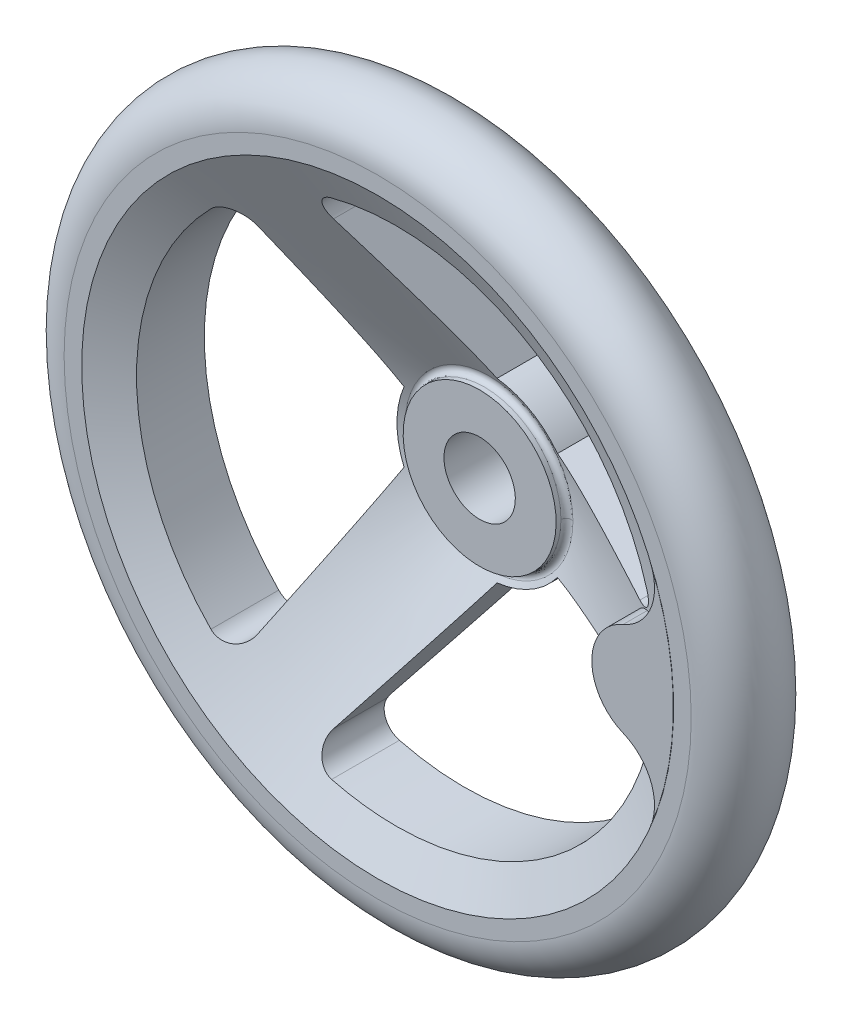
ISO-10303-21;
HEADER;
FILE_DESCRIPTION(('STEP AP214'),'2;1');
FILE_NAME('part.step','',(''),(''),'','','');
FILE_SCHEMA(('AUTOMOTIVE_DESIGN { 1 0 10303 214 1 1 1 1 }'));
ENDSEC;
DATA;
#1=APPLICATION_CONTEXT('core data for automotive mechanical design processes');
#2=APPLICATION_PROTOCOL_DEFINITION('international standard','automotive_design',2000,#1);
#3=PRODUCT_CONTEXT('',#1,'mechanical');
#4=PRODUCT('Part','Part','',(#3));
#5=PRODUCT_RELATED_PRODUCT_CATEGORY('part','',(#4));
#6=PRODUCT_DEFINITION_FORMATION('','',#4);
#7=PRODUCT_DEFINITION_CONTEXT('part definition',#1,'design');
#8=PRODUCT_DEFINITION('design','',#6,#7);
#9=PRODUCT_DEFINITION_SHAPE('','',#8);
#10=(LENGTH_UNIT() NAMED_UNIT(*) SI_UNIT(.MILLI.,.METRE.));
#11=(NAMED_UNIT(*) PLANE_ANGLE_UNIT() SI_UNIT($,.RADIAN.));
#12=(NAMED_UNIT(*) SI_UNIT($,.STERADIAN.) SOLID_ANGLE_UNIT());
#13=UNCERTAINTY_MEASURE_WITH_UNIT(LENGTH_MEASURE(1.E-05),#10,'distance_accuracy_value','');
#14=(GEOMETRIC_REPRESENTATION_CONTEXT(3) GLOBAL_UNCERTAINTY_ASSIGNED_CONTEXT((#13)) GLOBAL_UNIT_ASSIGNED_CONTEXT((#10,
#11,#12)) REPRESENTATION_CONTEXT('',''));
#15=CARTESIAN_POINT('',(0.,0.,0.));
#16=DIRECTION('',(0.,0.,1.));
#17=DIRECTION('',(1.,0.,0.));
#18=AXIS2_PLACEMENT_3D('',#15,#16,#17);
#19=CARTESIAN_POINT('',(0.,0.,0.));
#20=DIRECTION('',(0.,0.,1.));
#21=DIRECTION('',(0.,-1.,0.));
#22=AXIS2_PLACEMENT_3D('',#19,#20,#21);
#23=CYLINDRICAL_SURFACE('',#22,7.);
#24=CARTESIAN_POINT('',(0.,0.,19.000000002));
#25=DIRECTION('',(0.,0.,1.));
#26=DIRECTION('',(0.,-1.,0.));
#27=AXIS2_PLACEMENT_3D('',#24,#25,#26);
#28=CIRCLE('',#27,7.);
#29=CARTESIAN_POINT('',(0.,-7.,19.000000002));
#30=VERTEX_POINT('',#29);
#31=EDGE_CURVE('E158',#30,#30,#28,.T.);
#32=ORIENTED_EDGE('',*,*,#31,.T.);
#33=EDGE_LOOP('',(#32));
#34=FACE_BOUND('',#33,.T.);
#35=CARTESIAN_POINT('',(0.,0.,0.));
#36=DIRECTION('',(0.,0.,1.));
#37=DIRECTION('',(0.,-1.,0.));
#38=AXIS2_PLACEMENT_3D('',#35,#36,#37);
#39=CIRCLE('',#38,7.);
#40=CARTESIAN_POINT('',(0.,-7.,0.));
#41=VERTEX_POINT('',#40);
#42=EDGE_CURVE('E194',#41,#41,#39,.F.);
#43=ORIENTED_EDGE('',*,*,#42,.T.);
#44=EDGE_LOOP('',(#43));
#45=FACE_BOUND('',#44,.T.);
#46=ADVANCED_FACE('F14',(#34,#45),#23,.F.);
#47=CARTESIAN_POINT('',(-15.180469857,-15.23270539,0.));
#48=DIRECTION('',(0.,0.,1.));
#49=DIRECTION('',(1.,0.,0.));
#50=AXIS2_PLACEMENT_3D('',#47,#48,#49);
#51=PLANE('',#50);
#52=ORIENTED_EDGE('',*,*,#42,.F.);
#53=EDGE_LOOP('',(#52));
#54=FACE_BOUND('',#53,.T.);
#55=CARTESIAN_POINT('',(0.,0.,0.));
#56=DIRECTION('',(0.,0.,-1.));
#57=DIRECTION('',(-1.,0.,0.));
#58=AXIS2_PLACEMENT_3D('',#55,#56,#57);
#59=CIRCLE('',#58,16.);
#60=CARTESIAN_POINT('',(-16.,0.,0.));
#61=VERTEX_POINT('',#60);
#62=EDGE_CURVE('E196',#61,#61,#59,.T.);
#63=ORIENTED_EDGE('',*,*,#62,.T.);
#64=EDGE_LOOP('',(#63));
#65=FACE_BOUND('',#64,.T.);
#66=ADVANCED_FACE('F229',(#54,#65),#51,.F.);
#67=CARTESIAN_POINT('',(15.180469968,-15.2327055,19.000000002));
#68=DIRECTION('',(0.,0.,-1.));
#69=DIRECTION('',(-1.,0.,0.));
#70=AXIS2_PLACEMENT_3D('',#67,#68,#69);
#71=PLANE('',#70);
#72=ORIENTED_EDGE('',*,*,#31,.F.);
#73=EDGE_LOOP('',(#72));
#74=FACE_BOUND('',#73,.T.);
#75=CARTESIAN_POINT('',(0.,0.,19.000000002));
#76=DIRECTION('',(0.,0.,-1.));
#77=DIRECTION('',(0.,1.,0.));
#78=AXIS2_PLACEMENT_3D('',#75,#76,#77);
#79=CIRCLE('',#78,15.000464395);
#80=CARTESIAN_POINT('',(0.,15.000464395,19.000000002));
#81=VERTEX_POINT('',#80);
#82=EDGE_CURVE('E157',#81,#81,#79,.T.);
#83=ORIENTED_EDGE('',*,*,#82,.F.);
#84=EDGE_LOOP('',(#83));
#85=FACE_BOUND('',#84,.T.);
#86=ADVANCED_FACE('F232',(#74,#85),#71,.F.);
#87=CARTESIAN_POINT('',(41.874692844,22.57538449,39.));
#88=DIRECTION('',(0.,0.,1.));
#89=DIRECTION('',(0.,-1.,0.));
#90=AXIS2_PLACEMENT_3D('',#87,#88,#89);
#91=PLANE('',#90);
#92=CARTESIAN_POINT('',(44.30769235,-18.46153855,39.));
#93=DIRECTION('',(0.,0.,1.));
#94=DIRECTION('',(0.,-1.,0.));
#95=AXIS2_PLACEMENT_3D('',#92,#93,#94);
#96=CIRCLE('',#95,10.);
#97=CARTESIAN_POINT('',(48.1538462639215,-9.23076934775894,39.));
#98=VERTEX_POINT('',#97);
#99=CARTESIAN_POINT('',(53.5384615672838,-22.3076924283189,39.));
#100=VERTEX_POINT('',#99);
#101=EDGE_CURVE('E166',#98,#100,#96,.F.);
#102=ORIENTED_EDGE('',*,*,#101,.T.);
#103=CARTESIAN_POINT('',(0.,0.,39.));
#104=DIRECTION('',(0.,0.,1.));
#105=DIRECTION('',(1.,0.,0.));
#106=AXIS2_PLACEMENT_3D('',#103,#104,#105);
#107=CIRCLE('',#106,58.000000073);
#108=CARTESIAN_POINT('',(53.5384616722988,22.3076921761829,39.));
#109=VERTEX_POINT('',#108);
#110=EDGE_CURVE('E162',#109,#100,#107,.F.);
#111=ORIENTED_EDGE('',*,*,#110,.F.);
#112=CARTESIAN_POINT('',(44.307692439,18.461538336,39.));
#113=DIRECTION('',(0.,0.,1.));
#114=DIRECTION('',(0.,-1.,0.));
#115=AXIS2_PLACEMENT_3D('',#112,#113,#114);
#116=CIRCLE('',#115,10.);
#117=CARTESIAN_POINT('',(48.1538462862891,9.23076910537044,39.));
#118=VERTEX_POINT('',#117);
#119=EDGE_CURVE('E147',#109,#118,#116,.F.);
#120=ORIENTED_EDGE('',*,*,#119,.T.);
#121=CARTESIAN_POINT('',(52.000000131,-1.26000000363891E-07,39.));
#122=DIRECTION('',(0.,0.,1.));
#123=DIRECTION('',(1.,0.,0.));
#124=AXIS2_PLACEMENT_3D('',#121,#122,#123);
#125=CIRCLE('',#124,10.);
#126=EDGE_CURVE('E186',#98,#118,#125,.F.);
#127=ORIENTED_EDGE('',*,*,#126,.F.);
#128=EDGE_LOOP('',(#102,#111,#120,#127));
#129=FACE_BOUND('',#128,.T.);
#130=ADVANCED_FACE('F168',(#129),#91,.T.);
#131=CARTESIAN_POINT('',(44.307692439,18.461538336,34.236443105));
#132=DIRECTION('',(0.,0.,1.));
#133=DIRECTION('',(0.,-1.,0.));
#134=AXIS2_PLACEMENT_3D('',#131,#132,#133);
#135=CYLINDRICAL_SURFACE('',#134,10.);
#136=DIRECTION('',(0.,0.,-1.));
#137=VECTOR('',#136,1.);
#138=CARTESIAN_POINT('',(48.153846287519,9.2307691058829,34.7616407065));
#139=LINE('',#138,#137);
#140=CARTESIAN_POINT('',(48.1538462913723,9.23076910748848,34.2648539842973));
#141=VERTEX_POINT('',#140);
#142=EDGE_CURVE('E154',#118,#141,#139,.T.);
#143=ORIENTED_EDGE('',*,*,#142,.F.);
#144=ORIENTED_EDGE('',*,*,#119,.F.);
#145=DIRECTION('',(0.,0.,1.));
#146=VECTOR('',#145,1.);
#147=CARTESIAN_POINT('',(53.5384616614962,22.3076922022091,38.9868613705));
#148=LINE('',#147,#146);
#149=CARTESIAN_POINT('',(53.5384616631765,22.3076921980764,38.9737227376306));
#150=VERTEX_POINT('',#149);
#151=EDGE_CURVE('E151',#150,#109,#148,.T.);
#152=ORIENTED_EDGE('',*,*,#151,.F.);
#153=CARTESIAN_POINT('',(53.5384616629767,22.3076921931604,38.9737227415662));
#154=CARTESIAN_POINT('',(53.63998359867,22.0641449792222,38.9737360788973));
#155=CARTESIAN_POINT('',(53.7317878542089,21.8165614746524,38.9691860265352));
#156=CARTESIAN_POINT('',(53.8954718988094,21.3152681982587,38.9510572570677));
#157=CARTESIAN_POINT('',(53.9673556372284,21.0615596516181,38.9374803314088));
#158=CARTESIAN_POINT('',(54.0905772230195,20.5505817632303,38.9014464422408));
#159=CARTESIAN_POINT('',(54.1419721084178,20.2933243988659,38.8790144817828));
#160=CARTESIAN_POINT('',(54.2243180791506,19.7764552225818,38.8254540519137));
#161=CARTESIAN_POINT('',(54.2552688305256,19.5168433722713,38.7943254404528));
#162=CARTESIAN_POINT('',(54.2967338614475,18.9972298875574,38.7236257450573));
#163=CARTESIAN_POINT('',(54.3072546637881,18.7372284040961,38.6840573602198));
#164=CARTESIAN_POINT('',(54.3081034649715,18.2185586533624,38.596769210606));
#165=CARTESIAN_POINT('',(54.2984303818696,17.9598904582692,38.5490490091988));
#166=CARTESIAN_POINT('',(54.2592909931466,17.4455515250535,38.4457873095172));
#167=CARTESIAN_POINT('',(54.22981820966,17.1898817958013,38.3902432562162));
#168=CARTESIAN_POINT('',(54.1516451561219,16.6832536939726,38.2717290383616));
#169=CARTESIAN_POINT('',(54.1029445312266,16.4322954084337,38.2087587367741));
#170=CARTESIAN_POINT('',(53.9852528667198,15.9290236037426,38.0737719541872));
#171=CARTESIAN_POINT('',(53.9156874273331,15.6769028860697,38.0015378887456));
#172=CARTESIAN_POINT('',(53.7577650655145,15.180692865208,37.8500696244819));
#173=CARTESIAN_POINT('',(53.6694017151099,14.936606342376,37.7708330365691));
#174=CARTESIAN_POINT('',(53.4749278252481,14.4579771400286,37.6058935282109));
#175=CARTESIAN_POINT('',(53.3688226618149,14.2234315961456,37.5201925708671));
#176=CARTESIAN_POINT('',(53.1398713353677,13.7649101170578,37.3427618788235));
#177=CARTESIAN_POINT('',(53.017017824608,13.5409388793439,37.2510295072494));
#178=CARTESIAN_POINT('',(52.7455751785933,13.0877877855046,37.0547263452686));
#179=CARTESIAN_POINT('',(52.5957286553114,12.8595528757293,36.9497117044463));
#180=CARTESIAN_POINT('',(52.279425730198,12.4179282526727,36.7339520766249));
#181=CARTESIAN_POINT('',(52.1129746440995,12.2045338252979,36.6232089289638));
#182=CARTESIAN_POINT('',(51.7646720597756,11.7932434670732,36.3964420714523));
#183=CARTESIAN_POINT('',(51.5828033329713,11.595365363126,36.280412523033));
#184=CARTESIAN_POINT('',(51.2053319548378,11.2162568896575,36.0438286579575));
#185=CARTESIAN_POINT('',(51.0097333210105,11.0350216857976,35.9232756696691));
#186=CARTESIAN_POINT('',(50.60734659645,10.6908207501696,35.6789144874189));
#187=CARTESIAN_POINT('',(50.4006295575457,10.5277556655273,35.5551290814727));
#188=CARTESIAN_POINT('',(49.9763432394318,10.2192569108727,35.3042101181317));
#189=CARTESIAN_POINT('',(49.7587733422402,10.0738242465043,35.1770763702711));
#190=CARTESIAN_POINT('',(49.3145990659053,9.80136407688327,34.9203080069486));
#191=CARTESIAN_POINT('',(49.0880145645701,9.67429865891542,34.7906791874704));
#192=CARTESIAN_POINT('',(48.6267154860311,9.4386146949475,34.5292552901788));
#193=CARTESIAN_POINT('',(48.3920024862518,9.32999259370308,34.3974606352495));
#194=CARTESIAN_POINT('',(48.1538462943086,9.23076910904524,34.2648539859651));
#195=B_SPLINE_CURVE_WITH_KNOTS('',3,(#153,#154,#155,#156,#157,#158,#159,#160,#161,#162,#163,
#164,#165,#166,#167,#168,#169,#170,#171,#172,#173,#174,#175,#176,#177,#178,#179,#180,#181,#182,
#183,#184,#185,#186,#187,#188,#189,#190,#191,#192,#193,#194),.UNSPECIFIED.,.F.,.F.,(4,2,2,2,2,2,
2,2,2,2,2,2,2,2,2,2,2,2,2,2,4),(0.,0.79131382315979,1.58247065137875,2.371409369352,
3.16036097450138,3.94906064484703,4.73780257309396,5.52680267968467,6.31581734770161,
7.12893550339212,7.94233215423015,8.75548277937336,9.56899130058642,10.445640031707,
11.3220090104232,12.1993705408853,13.0764764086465,13.9485229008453,14.8206191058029,
15.6908886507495,16.5609902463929),.UNSPECIFIED.);
#196=EDGE_CURVE('E173',#150,#141,#195,.T.);
#197=ORIENTED_EDGE('',*,*,#196,.T.);
#198=EDGE_LOOP('',(#143,#144,#152,#197));
#199=FACE_BOUND('',#198,.T.);
#200=ADVANCED_FACE('F149',(#199),#135,.F.);
#201=CARTESIAN_POINT('',(0.,0.,19.000000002));
#202=DIRECTION('',(0.,0.,-1.));
#203=DIRECTION('',(0.,1.,0.));
#204=AXIS2_PLACEMENT_3D('',#201,#202,#203);
#205=CYLINDRICAL_SURFACE('',#204,15.000464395);
#206=ORIENTED_EDGE('',*,*,#82,.T.);
#207=EDGE_LOOP('',(#206));
#208=FACE_BOUND('',#207,.T.);
#209=CARTESIAN_POINT('',(0.,0.,18.053702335));
#210=DIRECTION('',(0.,0.,1.));
#211=DIRECTION('',(0.,-1.,0.));
#212=AXIS2_PLACEMENT_3D('',#209,#210,#211);
#213=CIRCLE('',#212,15.000464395);
#214=CARTESIAN_POINT('',(-15.000464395,-6.734730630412E-10,18.053702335));
#215=VERTEX_POINT('',#214);
#216=CARTESIAN_POINT('',(15.000464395,-1.53832333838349E-09,18.053702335));
#217=VERTEX_POINT('',#216);
#218=EDGE_CURVE('E411',#215,#217,#213,.T.);
#219=ORIENTED_EDGE('',*,*,#218,.T.);
#220=CARTESIAN_POINT('',(0.,0.,18.053702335));
#221=DIRECTION('',(0.,0.,1.));
#222=DIRECTION('',(0.,-1.,0.));
#223=AXIS2_PLACEMENT_3D('',#220,#221,#222);
#224=CIRCLE('',#223,15.000464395);
#225=EDGE_CURVE('E189',#217,#215,#224,.T.);
#226=ORIENTED_EDGE('',*,*,#225,.T.);
#227=EDGE_LOOP('',(#219,#226));
#228=FACE_BOUND('',#227,.T.);
#229=ADVANCED_FACE('F540',(#208,#228),#205,.T.);
#230=CARTESIAN_POINT('',(-15.000464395,0.,18.053702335));
#231=CARTESIAN_POINT('',(-15.000464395,30.00092879,18.053702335));
#232=CARTESIAN_POINT('',(15.000464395,30.00092879,18.053702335));
#233=CARTESIAN_POINT('',(15.000464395,0.,18.053702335));
#234=CARTESIAN_POINT('',(-15.000464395,0.,17.212432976));
#235=CARTESIAN_POINT('',(-15.000464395,30.00092879,17.212432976));
#236=CARTESIAN_POINT('',(15.000464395,30.00092879,17.212432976));
#237=CARTESIAN_POINT('',(15.000464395,0.,17.212432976));
#238=CARTESIAN_POINT('',(-15.720432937,0.,16.777255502));
#239=CARTESIAN_POINT('',(-15.720432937,31.440865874,16.777255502));
#240=CARTESIAN_POINT('',(15.720432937,31.440865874,16.777255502));
#241=CARTESIAN_POINT('',(15.720432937,0.,16.777255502));
#242=CARTESIAN_POINT('',(-16.465293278,0.,17.168301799));
#243=CARTESIAN_POINT('',(-16.465293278,32.930586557,17.168301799));
#244=CARTESIAN_POINT('',(16.465293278,32.930586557,17.168301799));
#245=CARTESIAN_POINT('',(16.465293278,0.,17.168301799));
#246=(BOUNDED_SURFACE() B_SPLINE_SURFACE(3,3,((#230,#231,#232,#233),(#234,#235,#236,#237),(#238,
#239,#240,#241),(#242,#243,#244,#245)),.UNSPECIFIED.,.F.,.F.,
.F.) B_SPLINE_SURFACE_WITH_KNOTS((4,4),(4,4),(0.,1.),(0.,1.),
.UNSPECIFIED.) GEOMETRIC_REPRESENTATION_ITEM() RATIONAL_B_SPLINE_SURFACE(((1.,0.333333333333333,
0.333333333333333,1.),(0.678191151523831,0.22606371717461,0.22606371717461,0.678191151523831),
(0.678191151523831,0.22606371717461,0.22606371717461,0.678191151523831),(1.,0.333333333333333,
0.333333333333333,1.))) REPRESENTATION_ITEM('') SURFACE());
#247=CARTESIAN_POINT('',(0.,0.,17.168301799));
#248=DIRECTION('',(0.,0.,1.));
#249=DIRECTION('',(1.,0.,0.));
#250=AXIS2_PLACEMENT_3D('',#247,#248,#249);
#251=CIRCLE('',#250,16.465293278);
#252=CARTESIAN_POINT('',(16.465293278,-2.21771763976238E-09,17.168301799));
#253=VERTEX_POINT('',#252);
#254=CARTESIAN_POINT('',(-16.465293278,-4.22136012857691E-09,17.168301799));
#255=VERTEX_POINT('',#254);
#256=EDGE_CURVE('E425',#253,#255,#251,.T.);
#257=CARTESIAN_POINT('',(-15.000464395,0.,18.053702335));
#258=CARTESIAN_POINT('',(-15.000464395,0.,17.212432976));
#259=CARTESIAN_POINT('',(-15.720432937,0.,16.777255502));
#260=CARTESIAN_POINT('',(-16.465293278,0.,17.168301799));
#261=(BOUNDED_CURVE() B_SPLINE_CURVE(3,(#257,#258,#259,#260),.UNSPECIFIED.,.F.,
.F.) B_SPLINE_CURVE_WITH_KNOTS((4,4),(0.,1.),
.UNSPECIFIED.) CURVE() GEOMETRIC_REPRESENTATION_ITEM() RATIONAL_B_SPLINE_CURVE((1.,
0.67819115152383,0.67819115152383,1.)) REPRESENTATION_ITEM(''));
#262=EDGE_CURVE('E419',#255,#215,#261,.F.);
#263=CARTESIAN_POINT('',(15.000464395,0.,18.053702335));
#264=CARTESIAN_POINT('',(15.000464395,0.,17.212432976));
#265=CARTESIAN_POINT('',(15.720432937,0.,16.777255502));
#266=CARTESIAN_POINT('',(16.465293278,0.,17.168301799));
#267=(BOUNDED_CURVE() B_SPLINE_CURVE(3,(#263,#264,#265,#266),.UNSPECIFIED.,.F.,
.F.) B_SPLINE_CURVE_WITH_KNOTS((4,4),(0.,1.),
.UNSPECIFIED.) CURVE() GEOMETRIC_REPRESENTATION_ITEM() RATIONAL_B_SPLINE_CURVE((1.,
0.67819115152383,0.67819115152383,1.)) REPRESENTATION_ITEM(''));
#268=EDGE_CURVE('E404',#217,#253,#267,.T.);
#269=ORIENTED_EDGE('',*,*,#256,.T.);
#270=ORIENTED_EDGE('',*,*,#262,.T.);
#271=ORIENTED_EDGE('',*,*,#225,.F.);
#272=ORIENTED_EDGE('',*,*,#268,.T.);
#273=EDGE_LOOP('',(#269,#270,#271,#272));
#274=FACE_BOUND('',#273,.T.);
#275=ADVANCED_FACE('F543',(#274),#246,.F.);
#276=CARTESIAN_POINT('',(0.,0.,6.153148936));
#277=DIRECTION('',(0.,0.,1.));
#278=DIRECTION('',(0.,-1.,0.));
#279=AXIS2_PLACEMENT_3D('',#276,#277,#278);
#280=CYLINDRICAL_SURFACE('',#279,17.5);
#281=DIRECTION('',(0.,0.,1.));
#282=VECTOR('',#281,1.);
#283=CARTESIAN_POINT('',(2.126831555,17.370278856,19.3735816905));
#284=LINE('',#283,#282);
#285=CARTESIAN_POINT('',(2.126831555,17.370278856,6.15314893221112));
#286=VERTEX_POINT('',#285);
#287=CARTESIAN_POINT('',(2.12683156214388,17.3702788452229,17.7115153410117));
#288=VERTEX_POINT('',#287);
#289=EDGE_CURVE('E502',#286,#288,#284,.T.);
#290=ORIENTED_EDGE('',*,*,#289,.T.);
#291=CARTESIAN_POINT('',(0.,0.,17.7115153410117));
#292=DIRECTION('',(0.,0.,1.));
#293=DIRECTION('',(1.,0.,0.));
#294=AXIS2_PLACEMENT_3D('',#291,#292,#293);
#295=CIRCLE('',#294,17.4999999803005);
#296=CARTESIAN_POINT('',(13.9796869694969,10.5270295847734,17.711515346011));
#297=VERTEX_POINT('',#296);
#298=EDGE_CURVE('E437',#288,#297,#295,.F.);
#299=ORIENTED_EDGE('',*,*,#298,.T.);
#300=DIRECTION('',(0.,0.,-1.));
#301=VECTOR('',#300,1.);
#302=CARTESIAN_POINT('',(13.979686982,10.527029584,19.373581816));
#303=LINE('',#302,#301);
#304=CARTESIAN_POINT('',(13.9796869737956,10.5270295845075,6.15314893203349));
#305=VERTEX_POINT('',#304);
#306=EDGE_CURVE('E495',#297,#305,#303,.T.);
#307=ORIENTED_EDGE('',*,*,#306,.T.);
#308=CARTESIAN_POINT('',(0.,0.,6.15314892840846));
#309=DIRECTION('',(0.,0.,1.));
#310=DIRECTION('',(1.,0.,0.));
#311=AXIS2_PLACEMENT_3D('',#308,#309,#310);
#312=CIRCLE('',#311,17.4999999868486);
#313=EDGE_CURVE('E435',#286,#305,#312,.F.);
#314=ORIENTED_EDGE('',*,*,#313,.F.);
#315=EDGE_LOOP('',(#290,#299,#307,#314));
#316=FACE_BOUND('',#315,.T.);
#317=ADVANCED_FACE('F549',(#316),#280,.T.);
#318=CARTESIAN_POINT('',(52.000000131,-1.26000000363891E-07,30.523281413));
#319=DIRECTION('',(0.,0.,1.));
#320=DIRECTION('',(1.,0.,0.));
#321=AXIS2_PLACEMENT_3D('',#318,#319,#320);
#322=CYLINDRICAL_SURFACE('',#321,10.);
#323=ORIENTED_EDGE('',*,*,#142,.T.);
#324=CARTESIAN_POINT('',(48.1538462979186,9.230769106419,34.2648539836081));
#325=CARTESIAN_POINT('',(47.8817816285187,9.11741160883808,34.1133862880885));
#326=CARTESIAN_POINT('',(47.6141627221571,8.99178376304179,33.9630283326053));
#327=CARTESIAN_POINT('',(47.08950088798,8.71635323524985,33.6656922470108));
#328=CARTESIAN_POINT('',(46.8324632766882,8.56653858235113,33.5187158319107));
#329=CARTESIAN_POINT('',(46.3290000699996,8.24197456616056,33.2283474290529));
#330=CARTESIAN_POINT('',(46.0826709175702,8.06704287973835,33.0849915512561));
#331=CARTESIAN_POINT('',(45.6047503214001,7.69368013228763,32.8045060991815));
#332=CARTESIAN_POINT('',(45.3731568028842,7.49525239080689,32.6673756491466));
#333=CARTESIAN_POINT('',(44.9259543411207,7.07477270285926,32.4004306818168));
#334=CARTESIAN_POINT('',(44.7104063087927,6.85263782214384,32.2706444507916));
#335=CARTESIAN_POINT('',(44.298517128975,6.38622953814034,32.020735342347));
#336=CARTESIAN_POINT('',(44.1021734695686,6.14195903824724,31.9006112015));
#337=CARTESIAN_POINT('',(43.7316225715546,5.6331773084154,31.6723103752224));
#338=CARTESIAN_POINT('',(43.5573522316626,5.36872740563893,31.5640997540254));
#339=CARTESIAN_POINT('',(43.2328350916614,4.82059708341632,31.3613404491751));
#340=CARTESIAN_POINT('',(43.0825788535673,4.53692428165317,31.2667863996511));
#341=CARTESIAN_POINT('',(42.8433747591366,4.02669131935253,31.1154670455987));
#342=CARTESIAN_POINT('',(42.7485447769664,3.80390435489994,31.0552011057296));
#343=CARTESIAN_POINT('',(42.5746680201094,3.34994820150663,30.9443245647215));
#344=CARTESIAN_POINT('',(42.4956177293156,3.11878089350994,30.8937118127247));
#345=CARTESIAN_POINT('',(42.3543470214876,2.64976633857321,30.8030163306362));
#346=CARTESIAN_POINT('',(42.2920990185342,2.41193075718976,30.7629163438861));
#347=CARTESIAN_POINT('',(42.1850875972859,1.93085005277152,30.6938441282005));
#348=CARTESIAN_POINT('',(42.1403177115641,1.6876069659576,30.6648677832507));
#349=CARTESIAN_POINT('',(42.0698880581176,1.20446558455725,30.6192296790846));
#350=CARTESIAN_POINT('',(42.0437134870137,0.9646737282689,30.6022362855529));
#351=CARTESIAN_POINT('',(42.0087681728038,0.48325613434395,30.5795397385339));
#352=CARTESIAN_POINT('',(41.9999998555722,0.241630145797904,30.5738381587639));
#353=CARTESIAN_POINT('',(42.000000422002,-0.249911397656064,30.5738386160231));
#354=CARTESIAN_POINT('',(42.0093806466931,-0.499827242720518,30.5799381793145));
#355=CARTESIAN_POINT('',(42.0467679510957,-0.997764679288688,30.6042194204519));
#356=CARTESIAN_POINT('',(42.0747825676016,-1.24578546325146,30.6224059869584));
#357=CARTESIAN_POINT('',(42.1490872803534,-1.73828349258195,30.6705447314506));
#358=CARTESIAN_POINT('',(42.195404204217,-1.98275498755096,30.7005141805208));
#359=CARTESIAN_POINT('',(42.3056656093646,-2.46603289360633,30.7716594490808));
#360=CARTESIAN_POINT('',(42.3696115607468,-2.70483883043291,30.8128362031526));
#361=CARTESIAN_POINT('',(42.513961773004,-3.17412584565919,30.9054633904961));
#362=CARTESIAN_POINT('',(42.5942896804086,-3.40463991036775,30.9568661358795));
#363=CARTESIAN_POINT('',(42.7706303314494,-3.85716342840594,31.0692472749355));
#364=CARTESIAN_POINT('',(42.8666433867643,-4.07917271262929,31.130225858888));
#365=CARTESIAN_POINT('',(43.0732807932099,-4.51347858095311,31.260854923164));
#366=CARTESIAN_POINT('',(43.1838983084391,-4.72577964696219,31.3305013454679));
#367=CARTESIAN_POINT('',(43.4187645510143,-5.13995176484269,31.4776229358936));
#368=CARTESIAN_POINT('',(43.5430181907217,-5.3418190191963,31.5551009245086));
#369=CARTESIAN_POINT('',(43.8131359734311,-5.74793558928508,31.7226053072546));
#370=CARTESIAN_POINT('',(43.959900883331,-5.95138118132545,31.8131291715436));
#371=CARTESIAN_POINT('',(44.2665603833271,-6.34477568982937,32.001090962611));
#372=CARTESIAN_POINT('',(44.4264596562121,-6.53471974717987,32.0985313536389));
#373=CARTESIAN_POINT('',(44.9242666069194,-7.08363798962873,32.3998848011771));
#374=CARTESIAN_POINT('',(45.280226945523,-7.42161427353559,32.6127949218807));
#375=CARTESIAN_POINT('',(46.0380106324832,-8.0436044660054,33.0595515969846));
#376=CARTESIAN_POINT('',(46.4405687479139,-8.32648780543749,33.2937158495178));
#377=CARTESIAN_POINT('',(47.0674441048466,-8.70224753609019,33.6529655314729));
#378=CARTESIAN_POINT('',(47.2799857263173,-8.81930020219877,33.773906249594));
#379=CARTESIAN_POINT('',(47.7119558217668,-9.03720805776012,34.017920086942));
#380=CARTESIAN_POINT('',(47.9313825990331,-9.13806720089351,34.1409926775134));
#381=CARTESIAN_POINT('',(48.1538462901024,-9.23076935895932,34.2648540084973));
#382=B_SPLINE_CURVE_WITH_KNOTS('',3,(#324,#325,#326,#327,#328,#329,#330,#331,#332,#333,#334,
#335,#336,#337,#338,#339,#340,#341,#342,#343,#344,#345,#346,#347,#348,#349,#350,#351,#352,#353,
#354,#355,#356,#357,#358,#359,#360,#361,#362,#363,#364,#365,#366,#367,#368,#369,#370,#371,#372,
#373,#374,#375,#376,#377,#378,#379,#380,#381),.UNSPECIFIED.,.F.,.F.,(4,2,2,2,2,2,2,2,2,2,2,2,2,
2,2,2,2,2,2,2,2,2,2,2,2,2,2,2,4),(0.,0.99393749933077,1.98836845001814,2.99042173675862,
3.99233362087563,4.99787309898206,6.00328087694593,7.00574629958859,8.00781676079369,
8.75561065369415,9.5032377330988,10.2496297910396,10.9957453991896,11.7203021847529,
12.4449599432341,13.1944534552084,13.9442502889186,14.695150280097,15.4461129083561,
16.1936522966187,16.9412065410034,17.6884121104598,18.435887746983,19.2351440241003,
20.0346865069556,21.6340897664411,23.2634807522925,24.0763166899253,24.8889538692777),.UNSPECIFIED.);
#383=CARTESIAN_POINT('',(48.1538462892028,-9.23076935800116,34.2648540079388));
#384=VERTEX_POINT('',#383);
#385=EDGE_CURVE('E328',#141,#384,#382,.T.);
#386=ORIENTED_EDGE('',*,*,#385,.T.);
#387=DIRECTION('',(0.,0.,1.));
#388=VECTOR('',#387,1.);
#389=CARTESIAN_POINT('',(48.1538462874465,-9.23076935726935,36.618221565));
#390=LINE('',#389,#388);
#391=EDGE_CURVE('E185',#384,#98,#390,.T.);
#392=ORIENTED_EDGE('',*,*,#391,.T.);
#393=ORIENTED_EDGE('',*,*,#126,.T.);
#394=EDGE_LOOP('',(#323,#386,#392,#393));
#395=FACE_BOUND('',#394,.T.);
#396=ADVANCED_FACE('F556',(#395),#322,.T.);
#397=CARTESIAN_POINT('',(44.30769235,-18.46153855,34.23644313));
#398=DIRECTION('',(0.,0.,1.));
#399=DIRECTION('',(0.,-1.,0.));
#400=AXIS2_PLACEMENT_3D('',#397,#398,#399);
#401=CYLINDRICAL_SURFACE('',#400,10.);
#402=DIRECTION('',(0.,0.,-1.));
#403=VECTOR('',#402,1.);
#404=CARTESIAN_POINT('',(53.5384615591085,-22.3076924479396,38.9868613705));
#405=LINE('',#404,#403);
#406=CARTESIAN_POINT('',(53.5384615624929,-22.3076924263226,38.9737227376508));
#407=VERTEX_POINT('',#406);
#408=EDGE_CURVE('E171',#100,#407,#405,.T.);
#409=ORIENTED_EDGE('',*,*,#408,.F.);
#410=ORIENTED_EDGE('',*,*,#101,.F.);
#411=ORIENTED_EDGE('',*,*,#391,.F.);
#412=CARTESIAN_POINT('',(48.1538462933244,-9.2307693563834,34.264854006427));
#413=CARTESIAN_POINT('',(48.4316873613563,-9.34652045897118,34.4195601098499));
#414=CARTESIAN_POINT('',(48.7048483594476,-9.47507550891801,34.5731608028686));
#415=CARTESIAN_POINT('',(49.2398455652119,-9.75721332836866,34.8773022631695));
#416=CARTESIAN_POINT('',(49.5016780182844,-9.9108043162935,35.0278420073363));
#417=CARTESIAN_POINT('',(50.0127750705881,-10.2429463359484,35.3254376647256));
#418=CARTESIAN_POINT('',(50.2619916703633,-10.4215841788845,35.4724792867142));
#419=CARTESIAN_POINT('',(50.7446650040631,-10.8025636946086,35.7615930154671));
#420=CARTESIAN_POINT('',(50.9781233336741,-11.0049029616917,35.9036656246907));
#421=CARTESIAN_POINT('',(51.4276748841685,-11.4328541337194,36.1822936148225));
#422=CARTESIAN_POINT('',(51.6437213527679,-11.6585252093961,36.3188336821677));
#423=CARTESIAN_POINT('',(52.0554786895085,-12.131444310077,36.5850463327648));
#424=CARTESIAN_POINT('',(52.2511907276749,-12.378691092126,36.7147193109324));
#425=CARTESIAN_POINT('',(52.6197272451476,-12.8928780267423,36.9660550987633));
#426=CARTESIAN_POINT('',(52.7925846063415,-13.1597890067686,37.0877292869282));
#427=CARTESIAN_POINT('',(53.1134692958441,-13.7117828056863,37.3222883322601));
#428=CARTESIAN_POINT('',(53.2614991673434,-13.9968637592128,37.4351740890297));
#429=CARTESIAN_POINT('',(53.5204557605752,-14.5610289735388,37.6430731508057));
#430=CARTESIAN_POINT('',(53.6333328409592,-14.8389586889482,37.7387919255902));
#431=CARTESIAN_POINT('',(53.8343574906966,-15.4065011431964,37.921102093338));
#432=CARTESIAN_POINT('',(53.9225079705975,-15.6961125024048,38.0076945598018));
#433=CARTESIAN_POINT('',(54.0726364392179,-16.2848078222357,38.1710229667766));
#434=CARTESIAN_POINT('',(54.1346108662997,-16.583893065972,38.2477575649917));
#435=CARTESIAN_POINT('',(54.2311136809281,-17.188933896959,38.390638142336));
#436=CARTESIAN_POINT('',(54.2656455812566,-17.4948885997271,38.4567854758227));
#437=CARTESIAN_POINT('',(54.3043509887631,-18.0812128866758,38.572014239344));
#438=CARTESIAN_POINT('',(54.3111265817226,-18.3612106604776,38.622125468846));
#439=CARTESIAN_POINT('',(54.3010097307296,-18.9223174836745,38.7127442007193));
#440=CARTESIAN_POINT('',(54.2841201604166,-19.2034263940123,38.7532528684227));
#441=CARTESIAN_POINT('',(54.2265072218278,-19.7639889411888,38.8242517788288));
#442=CARTESIAN_POINT('',(54.1858231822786,-20.0434445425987,38.8547584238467));
#443=CARTESIAN_POINT('',(54.0807366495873,-20.5986802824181,38.9055524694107));
#444=CARTESIAN_POINT('',(54.0163467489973,-20.8744622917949,38.9258452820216));
#445=CARTESIAN_POINT('',(53.8852957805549,-21.3444994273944,38.9518608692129));
#446=CARTESIAN_POINT('',(53.8241974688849,-21.5401900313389,38.9600618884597));
#447=CARTESIAN_POINT('',(53.6901528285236,-21.927281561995,38.9709902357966));
#448=CARTESIAN_POINT('',(53.6172252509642,-22.1186887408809,38.9737261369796));
#449=CARTESIAN_POINT('',(53.5384615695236,-22.3076924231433,38.973722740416));
#450=B_SPLINE_CURVE_WITH_KNOTS('',3,(#412,#413,#414,#415,#416,#417,#418,#419,#420,#421,#422,
#423,#424,#425,#426,#427,#428,#429,#430,#431,#432,#433,#434,#435,#436,#437,#438,#439,#440,#441,
#442,#443,#444,#445,#446,#447,#448,#449),.UNSPECIFIED.,.F.,.F.,(4,2,2,2,2,2,2,2,2,2,2,2,2,2,2,2,
2,2,4),(0.,1.01503292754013,2.03039972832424,3.04937698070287,4.06825089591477,5.0897752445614,
6.11124078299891,7.13122032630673,8.15109532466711,9.09445981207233,10.0377132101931,
10.9810949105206,11.9243558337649,12.7768280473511,13.6291967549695,14.4801605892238,
15.3306730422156,15.9457489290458,16.5598591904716),.UNSPECIFIED.);
#451=EDGE_CURVE('E459',#384,#407,#450,.T.);
#452=ORIENTED_EDGE('',*,*,#451,.T.);
#453=EDGE_LOOP('',(#409,#410,#411,#452));
#454=FACE_BOUND('',#453,.T.);
#455=ADVANCED_FACE('F561',(#454),#401,.F.);
#456=CARTESIAN_POINT('',(0.,0.,38.973722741));
#457=DIRECTION('',(0.,0.,1.));
#458=DIRECTION('',(1.,0.,0.));
#459=AXIS2_PLACEMENT_3D('',#456,#457,#458);
#460=CYLINDRICAL_SURFACE('',#459,58.000000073);
#461=ORIENTED_EDGE('',*,*,#408,.T.);
#462=CARTESIAN_POINT('',(0.,0.,38.973722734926));
#463=DIRECTION('',(0.,0.,1.));
#464=DIRECTION('',(1.,0.,0.));
#465=AXIS2_PLACEMENT_3D('',#462,#463,#464);
#466=CIRCLE('',#465,58.0000000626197);
#467=EDGE_CURVE('E165',#407,#150,#466,.T.);
#468=ORIENTED_EDGE('',*,*,#467,.T.);
#469=ORIENTED_EDGE('',*,*,#151,.T.);
#470=ORIENTED_EDGE('',*,*,#110,.T.);
#471=EDGE_LOOP('',(#461,#468,#469,#470));
#472=FACE_BOUND('',#471,.T.);
#473=ADVANCED_FACE('F161',(#472),#460,.T.);
#474=CARTESIAN_POINT('',(62.238469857,-62.452630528,39.));
#475=DIRECTION('',(0.,0.,-1.));
#476=DIRECTION('',(-1.,0.,0.));
#477=AXIS2_PLACEMENT_3D('',#474,#475,#476);
#478=PLANE('',#477);
#479=CARTESIAN_POINT('',(0.,0.,39.));
#480=DIRECTION('',(0.,0.,1.));
#481=DIRECTION('',(0.,-1.,0.));
#482=AXIS2_PLACEMENT_3D('',#479,#480,#481);
#483=CIRCLE('',#482,58.050052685);
#484=CARTESIAN_POINT('',(0.,-58.050052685,39.));
#485=VERTEX_POINT('',#484);
#486=EDGE_CURVE('E364',#485,#485,#483,.F.);
#487=ORIENTED_EDGE('',*,*,#486,.T.);
#488=EDGE_LOOP('',(#487));
#489=FACE_BOUND('',#488,.T.);
#490=CARTESIAN_POINT('',(0.,0.,39.));
#491=DIRECTION('',(0.,0.,-1.));
#492=DIRECTION('',(0.,1.,0.));
#493=AXIS2_PLACEMENT_3D('',#490,#491,#492);
#494=CIRCLE('',#493,61.5004642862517);
#495=CARTESIAN_POINT('',(0.,61.5004642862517,39.));
#496=VERTEX_POINT('',#495);
#497=EDGE_CURVE('E401',#496,#496,#494,.T.);
#498=ORIENTED_EDGE('',*,*,#497,.F.);
#499=EDGE_LOOP('',(#498));
#500=FACE_BOUND('',#499,.T.);
#501=ADVANCED_FACE('F239',(#489,#500),#478,.F.);
#502=CARTESIAN_POINT('',(0.,0.,6.153149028));
#503=DIRECTION('',(0.,0.,1.));
#504=DIRECTION('',(0.,-1.,0.));
#505=AXIS2_PLACEMENT_3D('',#502,#503,#504);
#506=CYLINDRICAL_SURFACE('',#505,17.50000016);
#507=CARTESIAN_POINT('',(0.,0.,17.7115154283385));
#508=DIRECTION('',(0.,0.,1.));
#509=DIRECTION('',(1.,0.,0.));
#510=AXIS2_PLACEMENT_3D('',#507,#508,#509);
#511=CIRCLE('',#510,17.5000001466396);
#512=CARTESIAN_POINT('',(-16.106518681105,-6.84324932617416,17.7115154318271));
#513=VERTEX_POINT('',#512);
#514=CARTESIAN_POINT('',(-16.1065188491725,6.84324893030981,17.7115154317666));
#515=VERTEX_POINT('',#514);
#516=EDGE_CURVE('E354',#513,#515,#511,.F.);
#517=ORIENTED_EDGE('',*,*,#516,.T.);
#518=DIRECTION('',(0.,0.,-1.));
#519=VECTOR('',#518,1.);
#520=CARTESIAN_POINT('',(-16.106518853,6.843248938,19.3735818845));
#521=LINE('',#520,#519);
#522=CARTESIAN_POINT('',(-16.1065188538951,6.84324893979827,6.15314902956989));
#523=VERTEX_POINT('',#522);
#524=EDGE_CURVE('E506',#515,#523,#521,.T.);
#525=ORIENTED_EDGE('',*,*,#524,.T.);
#526=CARTESIAN_POINT('',(0.,0.,6.15314903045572));
#527=DIRECTION('',(0.,0.,1.));
#528=DIRECTION('',(1.,0.,0.));
#529=AXIS2_PLACEMENT_3D('',#526,#527,#528);
#530=CIRCLE('',#529,17.5000001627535);
#531=CARTESIAN_POINT('',(-16.106518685,-6.843249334,6.15314902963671));
#532=VERTEX_POINT('',#531);
#533=EDGE_CURVE('E327',#532,#523,#530,.F.);
#534=ORIENTED_EDGE('',*,*,#533,.F.);
#535=DIRECTION('',(0.,0.,1.));
#536=VECTOR('',#535,1.);
#537=CARTESIAN_POINT('',(-16.106518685,-6.843249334,19.373581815));
#538=LINE('',#537,#536);
#539=EDGE_CURVE('E479',#532,#513,#538,.T.);
#540=ORIENTED_EDGE('',*,*,#539,.T.);
#541=EDGE_LOOP('',(#517,#525,#534,#540));
#542=FACE_BOUND('',#541,.T.);
#543=ADVANCED_FACE('F242',(#542),#506,.T.);
#544=CARTESIAN_POINT('',(15.000464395,0.,18.053702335));
#545=CARTESIAN_POINT('',(15.000464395,-30.00092879,18.053702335));
#546=CARTESIAN_POINT('',(-15.000464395,-30.00092879,18.053702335));
#547=CARTESIAN_POINT('',(-15.000464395,0.,18.053702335));
#548=CARTESIAN_POINT('',(15.000464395,0.,17.212432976));
#549=CARTESIAN_POINT('',(15.000464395,-30.00092879,17.212432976));
#550=CARTESIAN_POINT('',(-15.000464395,-30.00092879,17.212432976));
#551=CARTESIAN_POINT('',(-15.000464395,0.,17.212432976));
#552=CARTESIAN_POINT('',(15.720432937,0.,16.777255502));
#553=CARTESIAN_POINT('',(15.720432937,-31.440865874,16.777255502));
#554=CARTESIAN_POINT('',(-15.720432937,-31.440865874,16.777255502));
#555=CARTESIAN_POINT('',(-15.720432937,0.,16.777255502));
#556=CARTESIAN_POINT('',(16.465293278,0.,17.168301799));
#557=CARTESIAN_POINT('',(16.465293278,-32.930586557,17.168301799));
#558=CARTESIAN_POINT('',(-16.465293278,-32.930586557,17.168301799));
#559=CARTESIAN_POINT('',(-16.465293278,0.,17.168301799));
#560=(BOUNDED_SURFACE() B_SPLINE_SURFACE(3,3,((#544,#545,#546,#547),(#548,#549,#550,#551),(#552,
#553,#554,#555),(#556,#557,#558,#559)),.UNSPECIFIED.,.F.,.F.,
.F.) B_SPLINE_SURFACE_WITH_KNOTS((4,4),(4,4),(0.,1.),(0.,1.),
.UNSPECIFIED.) GEOMETRIC_REPRESENTATION_ITEM() RATIONAL_B_SPLINE_SURFACE(((1.,0.333333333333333,
0.333333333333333,1.),(0.67819115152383,0.22606371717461,0.22606371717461,0.67819115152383),
(0.67819115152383,0.22606371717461,0.22606371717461,0.67819115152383),(1.,0.333333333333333,
0.333333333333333,1.))) REPRESENTATION_ITEM('') SURFACE());
#561=CARTESIAN_POINT('',(0.,0.,17.168301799));
#562=DIRECTION('',(0.,0.,1.));
#563=DIRECTION('',(1.,0.,0.));
#564=AXIS2_PLACEMENT_3D('',#561,#562,#563);
#565=CIRCLE('',#564,16.465293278);
#566=EDGE_CURVE('E346',#255,#253,#565,.T.);
#567=ORIENTED_EDGE('',*,*,#268,.F.);
#568=ORIENTED_EDGE('',*,*,#218,.F.);
#569=ORIENTED_EDGE('',*,*,#262,.F.);
#570=ORIENTED_EDGE('',*,*,#566,.T.);
#571=EDGE_LOOP('',(#567,#568,#569,#570));
#572=FACE_BOUND('',#571,.T.);
#573=ADVANCED_FACE('F582',(#572),#560,.F.);
#574=CARTESIAN_POINT('',(0.,0.,6.153148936));
#575=DIRECTION('',(0.,0.,1.));
#576=DIRECTION('',(0.,-1.,0.));
#577=AXIS2_PLACEMENT_3D('',#574,#575,#576);
#578=CYLINDRICAL_SURFACE('',#577,17.5);
#579=DIRECTION('',(0.,0.,1.));
#580=VECTOR('',#579,1.);
#581=CARTESIAN_POINT('',(13.979686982,-10.527029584,19.373581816));
#582=LINE('',#581,#580);
#583=CARTESIAN_POINT('',(13.9796869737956,-10.5270295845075,6.15314893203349));
#584=VERTEX_POINT('',#583);
#585=CARTESIAN_POINT('',(13.9796869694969,-10.5270295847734,17.711515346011));
#586=VERTEX_POINT('',#585);
#587=EDGE_CURVE('E326',#584,#586,#582,.T.);
#588=ORIENTED_EDGE('',*,*,#587,.T.);
#589=CARTESIAN_POINT('',(0.,0.,17.7115153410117));
#590=DIRECTION('',(0.,0.,1.));
#591=DIRECTION('',(1.,0.,0.));
#592=AXIS2_PLACEMENT_3D('',#589,#590,#591);
#593=CIRCLE('',#592,17.4999999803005);
#594=CARTESIAN_POINT('',(2.126831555,-17.370278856,17.7115153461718));
#595=VERTEX_POINT('',#594);
#596=EDGE_CURVE('E345',#586,#595,#593,.F.);
#597=ORIENTED_EDGE('',*,*,#596,.T.);
#598=DIRECTION('',(0.,0.,-1.));
#599=VECTOR('',#598,1.);
#600=CARTESIAN_POINT('',(2.126831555,-17.370278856,19.373581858));
#601=LINE('',#600,#599);
#602=CARTESIAN_POINT('',(2.12683155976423,-17.3702788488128,6.15314893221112));
#603=VERTEX_POINT('',#602);
#604=EDGE_CURVE('E408',#595,#603,#601,.T.);
#605=ORIENTED_EDGE('',*,*,#604,.T.);
#606=CARTESIAN_POINT('',(0.,0.,6.15314892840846));
#607=DIRECTION('',(0.,0.,1.));
#608=DIRECTION('',(1.,0.,0.));
#609=AXIS2_PLACEMENT_3D('',#606,#607,#608);
#610=CIRCLE('',#609,17.4999999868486);
#611=EDGE_CURVE('E277',#584,#603,#610,.F.);
#612=ORIENTED_EDGE('',*,*,#611,.F.);
#613=EDGE_LOOP('',(#588,#597,#605,#612));
#614=FACE_BOUND('',#613,.T.);
#615=ADVANCED_FACE('F248',(#614),#578,.T.);
#616=CARTESIAN_POINT('',(0.,0.,30.5));
#617=DIRECTION('',(0.,0.,-1.));
#618=DIRECTION('',(0.,1.,0.));
#619=AXIS2_PLACEMENT_3D('',#616,#617,#618);
#620=TOROIDAL_SURFACE('',#619,61.500464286,8.5);
#621=CARTESIAN_POINT('',(0.,0.,22.));
#622=DIRECTION('',(0.,0.,-1.));
#623=DIRECTION('',(0.,1.,0.));
#624=AXIS2_PLACEMENT_3D('',#621,#622,#623);
#625=CIRCLE('',#624,61.5004642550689);
#626=CARTESIAN_POINT('',(0.,61.5004642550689,22.));
#627=VERTEX_POINT('',#626);
#628=EDGE_CURVE('E475',#627,#627,#625,.F.);
#629=ORIENTED_EDGE('',*,*,#628,.T.);
#630=EDGE_LOOP('',(#629));
#631=FACE_BOUND('',#630,.T.);
#632=ORIENTED_EDGE('',*,*,#497,.T.);
#633=EDGE_LOOP('',(#632));
#634=FACE_BOUND('',#633,.T.);
#635=ADVANCED_FACE('F244',(#631,#634),#620,.T.);
#636=CARTESIAN_POINT('',(0.,0.,22.));
#637=DIRECTION('',(0.,0.,1.));
#638=DIRECTION('',(0.,-1.,0.));
#639=AXIS2_PLACEMENT_3D('',#636,#637,#638);
#640=CYLINDRICAL_SURFACE('',#639,51.);
#641=CARTESIAN_POINT('',(0.,0.,22.));
#642=DIRECTION('',(0.,0.,1.));
#643=DIRECTION('',(0.,-1.,0.));
#644=AXIS2_PLACEMENT_3D('',#641,#642,#643);
#645=CIRCLE('',#644,51.);
#646=CARTESIAN_POINT('',(49.133587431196,-13.6707931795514,22.));
#647=VERTEX_POINT('',#646);
#648=CARTESIAN_POINT('',(-12.7275394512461,-49.3863315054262,22.));
#649=VERTEX_POINT('',#648);
#650=EDGE_CURVE('E638',#647,#649,#645,.F.);
#651=ORIENTED_EDGE('',*,*,#650,.T.);
#652=DIRECTION('',(0.,0.,1.));
#653=VECTOR('',#652,1.);
#654=CARTESIAN_POINT('',(-12.7275394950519,-49.3863314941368,28.6892829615));
#655=LINE('',#654,#653);
#656=CARTESIAN_POINT('',(-12.7275394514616,-49.3863315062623,35.2987732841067));
#657=VERTEX_POINT('',#656);
#658=EDGE_CURVE('E403',#649,#657,#655,.T.);
#659=ORIENTED_EDGE('',*,*,#658,.T.);
#660=CARTESIAN_POINT('',(0.,0.,35.29877328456));
#661=DIRECTION('',(0.,0.,1.));
#662=DIRECTION('',(1.,0.,0.));
#663=AXIS2_PLACEMENT_3D('',#660,#661,#662);
#664=CIRCLE('',#663,51.0000000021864);
#665=CARTESIAN_POINT('',(49.1335874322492,-13.6707931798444,35.2987732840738));
#666=VERTEX_POINT('',#665);
#667=EDGE_CURVE('E469',#657,#666,#664,.T.);
#668=ORIENTED_EDGE('',*,*,#667,.T.);
#669=DIRECTION('',(0.,0.,-1.));
#670=VECTOR('',#669,1.);
#671=CARTESIAN_POINT('',(49.1335874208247,-13.6707932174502,28.689282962));
#672=LINE('',#671,#670);
#673=EDGE_CURVE('E472',#666,#647,#672,.T.);
#674=ORIENTED_EDGE('',*,*,#673,.T.);
#675=EDGE_LOOP('',(#651,#659,#668,#674));
#676=FACE_BOUND('',#675,.T.);
#677=ADVANCED_FACE('F247',(#676),#640,.F.);
#678=CARTESIAN_POINT('',(-11.729301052,-45.512893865,22.));
#679=DIRECTION('',(0.,0.,1.));
#680=DIRECTION('',(0.,-1.,0.));
#681=AXIS2_PLACEMENT_3D('',#678,#679,#680);
#682=CYLINDRICAL_SURFACE('',#681,3.999999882);
#683=CARTESIAN_POINT('',(-11.729301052,-45.512893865,22.));
#684=DIRECTION('',(0.,0.,1.));
#685=DIRECTION('',(0.,-1.,0.));
#686=AXIS2_PLACEMENT_3D('',#683,#684,#685);
#687=CIRCLE('',#686,3.999999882);
#688=CARTESIAN_POINT('',(-15.0633191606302,-43.3028435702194,22.));
#689=VERTEX_POINT('',#688);
#690=EDGE_CURVE('E627',#649,#689,#687,.F.);
#691=ORIENTED_EDGE('',*,*,#690,.T.);
#692=DIRECTION('',(0.,0.,1.));
#693=VECTOR('',#692,1.);
#694=CARTESIAN_POINT('',(-15.063319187,-43.30284361,19.373581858));
#695=LINE('',#694,#693);
#696=CARTESIAN_POINT('',(-15.063319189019,-43.3028436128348,32.5940147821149));
#697=VERTEX_POINT('',#696);
#698=EDGE_CURVE('E513',#689,#697,#695,.T.);
#699=ORIENTED_EDGE('',*,*,#698,.T.);
#700=CARTESIAN_POINT('',(-15.063319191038,-43.3028436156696,32.5940147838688));
#701=CARTESIAN_POINT('',(-15.1335398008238,-43.4087910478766,32.6586628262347));
#702=CARTESIAN_POINT('',(-15.198508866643,-43.5177542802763,32.7239130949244));
#703=CARTESIAN_POINT('',(-15.3176630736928,-43.7409783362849,32.8551840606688));
#704=CARTESIAN_POINT('',(-15.3718486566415,-43.8552389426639,32.9212047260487));
#705=CARTESIAN_POINT('',(-15.5178405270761,-44.2049357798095,33.1198114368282));
#706=CARTESIAN_POINT('',(-15.5930476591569,-44.4472350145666,33.2529104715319));
#707=CARTESIAN_POINT('',(-15.6966095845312,-44.9431409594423,33.5166013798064));
#708=CARTESIAN_POINT('',(-15.7249481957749,-45.1967515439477,33.6471923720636));
#709=CARTESIAN_POINT('',(-15.7307852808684,-45.5798396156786,33.8382562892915));
#710=CARTESIAN_POINT('',(-15.7266101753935,-45.7080326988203,33.901164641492));
#711=CARTESIAN_POINT('',(-15.7058164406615,-45.964376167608,34.0249268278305));
#712=CARTESIAN_POINT('',(-15.6892036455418,-46.0925265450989,34.0857816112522));
#713=CARTESIAN_POINT('',(-15.6439216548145,-46.3446047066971,34.2034856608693));
#714=CARTESIAN_POINT('',(-15.6155589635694,-46.4685588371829,34.2603966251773));
#715=CARTESIAN_POINT('',(-15.5467376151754,-46.7143305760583,34.3713046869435));
#716=CARTESIAN_POINT('',(-15.5062851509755,-46.8361492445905,34.4253032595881));
#717=CARTESIAN_POINT('',(-15.4132476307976,-47.0765935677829,34.5299288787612));
#718=CARTESIAN_POINT('',(-15.3606608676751,-47.1952187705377,34.5805554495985));
#719=CARTESIAN_POINT('',(-15.2434727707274,-47.4279812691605,34.677891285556));
#720=CARTESIAN_POINT('',(-15.1788786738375,-47.5421212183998,34.7246028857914));
#721=CARTESIAN_POINT('',(-15.0444007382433,-47.7544140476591,34.8095065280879));
#722=CARTESIAN_POINT('',(-14.9755555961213,-47.8530700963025,34.8480869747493));
#723=CARTESIAN_POINT('',(-14.8284697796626,-48.0446371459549,34.9212094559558));
#724=CARTESIAN_POINT('',(-14.7502343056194,-48.1375512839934,34.9557537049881));
#725=CARTESIAN_POINT('',(-14.5847649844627,-48.316675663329,35.0204467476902));
#726=CARTESIAN_POINT('',(-14.4975306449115,-48.4028855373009,35.0505953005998));
#727=CARTESIAN_POINT('',(-14.3146580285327,-48.5675726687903,35.1061295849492));
#728=CARTESIAN_POINT('',(-14.219021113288,-48.6460511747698,35.1315160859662));
#729=CARTESIAN_POINT('',(-14.0311343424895,-48.7860772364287,35.1746665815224));
#730=CARTESIAN_POINT('',(-13.9396852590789,-48.8485372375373,35.1929637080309));
#731=CARTESIAN_POINT('',(-13.7513787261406,-48.9659368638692,35.2253384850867));
#732=CARTESIAN_POINT('',(-13.6545220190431,-49.0208775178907,35.2394167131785));
#733=CARTESIAN_POINT('',(-13.4563659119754,-49.1225505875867,35.2631679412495));
#734=CARTESIAN_POINT('',(-13.3550772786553,-49.1693016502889,35.2728510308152));
#735=CARTESIAN_POINT('',(-13.1487120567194,-49.2542445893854,35.2877410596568));
#736=CARTESIAN_POINT('',(-13.0436382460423,-49.2924426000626,35.2929512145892));
#737=CARTESIAN_POINT('',(-12.9024704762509,-49.3371582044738,35.2968564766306));
#738=CARTESIAN_POINT('',(-12.8676541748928,-49.3476657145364,35.2975756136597));
#739=CARTESIAN_POINT('',(-12.7977808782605,-49.3677178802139,35.2985336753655));
#740=CARTESIAN_POINT('',(-12.7627241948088,-49.3772635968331,35.298773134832));
#741=CARTESIAN_POINT('',(-12.7275394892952,-49.3863314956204,35.2987732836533));
#742=B_SPLINE_CURVE_WITH_KNOTS('',3,(#700,#701,#702,#703,#704,#705,#706,#707,#708,#709,#710,
#711,#712,#713,#714,#715,#716,#717,#718,#719,#720,#721,#722,#723,#724,#725,#726,#727,#728,#729,
#730,#731,#732,#733,#734,#735,#736,#737,#738,#739,#740,#741),.UNSPECIFIED.,.F.,.F.,(4,2,2,2,2,2,
2,2,2,2,2,2,2,2,2,2,2,2,2,2,4),(0.,0.427536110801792,0.855054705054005,1.710298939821,
2.5658383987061,2.99394996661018,3.42186084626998,3.83924965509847,4.25642502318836,
4.67365911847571,5.09064255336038,5.46913460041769,5.84741800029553,6.22572211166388,
6.6039650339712,6.94025706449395,7.2765030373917,7.61197316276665,7.94720191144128,
8.05631328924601,8.16530295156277),.UNSPECIFIED.);
#743=EDGE_CURVE('E473',#697,#657,#742,.T.);
#744=ORIENTED_EDGE('',*,*,#743,.T.);
#745=ORIENTED_EDGE('',*,*,#658,.F.);
#746=EDGE_LOOP('',(#691,#699,#744,#745));
#747=FACE_BOUND('',#746,.T.);
#748=ADVANCED_FACE('F255',(#747),#682,.F.);
#749=CARTESIAN_POINT('',(2.126831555,-17.370278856,5.99450374));
#750=DIRECTION('',(-0.833504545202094,0.552512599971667,0.));
#751=DIRECTION('',(-0.552512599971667,-0.833504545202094,0.));
#752=AXIS2_PLACEMENT_3D('',#749,#750,#751);
#753=PLANE('',#752);
#754=DIRECTION('',(-0.552512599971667,-0.833504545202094,0.));
#755=VECTOR('',#754,1.);
#756=CARTESIAN_POINT('',(2.126831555,-17.370278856,22.));
#757=LINE('',#756,#755);
#758=CARTESIAN_POINT('',(-14.4743648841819,-42.4143641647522,21.9999999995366));
#759=VERTEX_POINT('',#758);
#760=EDGE_CURVE('E631',#689,#759,#757,.F.);
#761=ORIENTED_EDGE('',*,*,#760,.T.);
#762=CARTESIAN_POINT('',(2.12683155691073,-17.3702788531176,6.1531489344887));
#763=CARTESIAN_POINT('',(1.92873248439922,-17.6691253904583,6.31128923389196));
#764=CARTESIAN_POINT('',(1.73117830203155,-17.9671499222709,6.4716467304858));
#765=CARTESIAN_POINT('',(1.33704625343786,-18.5617261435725,6.79621706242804));
#766=CARTESIAN_POINT('',(1.14046835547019,-18.8582778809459,6.9604297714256));
#767=CARTESIAN_POINT('',(0.748187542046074,-19.4500613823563,7.2921206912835));
#768=CARTESIAN_POINT('',(0.5524845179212,-19.7452933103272,7.45959848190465));
#769=CARTESIAN_POINT('',(0.161827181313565,-20.3346276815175,7.79739601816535));
#770=CARTESIAN_POINT('',(-0.033127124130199,-20.628730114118,7.96771579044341));
#771=CARTESIAN_POINT('',(-0.6168733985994,-21.5093528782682,8.48223716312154));
#772=CARTESIAN_POINT('',(-1.00467773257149,-22.0943832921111,8.83011053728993));
#773=CARTESIAN_POINT('',(-1.7782284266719,-23.2613395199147,9.53331413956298));
#774=CARTESIAN_POINT('',(-2.16397470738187,-23.8432652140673,9.88864465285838));
#775=CARTESIAN_POINT('',(-2.93364456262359,-25.0043669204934,10.6049408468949));
#776=CARTESIAN_POINT('',(-3.31756888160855,-25.5835440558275,10.9659039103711));
#777=CARTESIAN_POINT('',(-4.08408558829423,-26.7398890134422,11.6924048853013));
#778=CARTESIAN_POINT('',(-4.46667799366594,-27.3170568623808,12.0579427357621));
#779=CARTESIAN_POINT('',(-5.2308174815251,-28.4698156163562,12.7927307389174));
#780=CARTESIAN_POINT('',(-5.61236446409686,-29.045406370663,13.1619812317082));
#781=CARTESIAN_POINT('',(-6.37456857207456,-30.1952454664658,13.9034813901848));
#782=CARTESIAN_POINT('',(-6.75522569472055,-30.7694938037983,14.2757310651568));
#783=CARTESIAN_POINT('',(-7.74979660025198,-32.2698747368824,15.2524977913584));
#784=CARTESIAN_POINT('',(-8.36311650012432,-33.1951114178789,15.8589953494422));
#785=CARTESIAN_POINT('',(-9.58827597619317,-35.0433516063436,17.0767628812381));
#786=CARTESIAN_POINT('',(-10.2001156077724,-35.9663551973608,17.6880326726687));
#787=CARTESIAN_POINT('',(-11.4228536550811,-37.8109424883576,18.9144321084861));
#788=CARTESIAN_POINT('',(-12.0337517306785,-38.7325256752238,19.5295628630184));
#789=CARTESIAN_POINT('',(-13.254667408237,-40.5743637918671,20.7627676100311));
#790=CARTESIAN_POINT('',(-13.8646849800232,-41.4946186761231,21.3808417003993));
#791=CARTESIAN_POINT('',(-14.4743648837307,-42.4143641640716,21.9999999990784));
#792=B_SPLINE_CURVE_WITH_KNOTS('',3,(#762,#763,#764,#765,#766,#767,#768,#769,#770,#771,#772,
#773,#774,#775,#776,#777,#778,#779,#780,#781,#782,#783,#784,#785,#786,#787,#788,#789,#790,#791),
.UNSPECIFIED.,.F.,.F.,(4,2,2,2,2,2,2,2,2,2,2,2,2,2,4),(0.,1.17558671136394,2.35113494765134,
3.52653286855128,4.70194181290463,7.05198582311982,9.4021198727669,11.7511926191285,
14.1002340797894,16.449492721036,18.7987586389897,22.5935495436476,26.3881962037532,
30.1839890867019,33.9799091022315),.UNSPECIFIED.);
#793=EDGE_CURVE('E269',#603,#759,#792,.T.);
#794=ORIENTED_EDGE('',*,*,#793,.F.);
#795=ORIENTED_EDGE('',*,*,#604,.F.);
#796=CARTESIAN_POINT('',(2.12683155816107,-17.3702788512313,17.7115153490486));
#797=CARTESIAN_POINT('',(1.92797586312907,-17.6702668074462,17.8551721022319));
#798=CARTESIAN_POINT('',(1.72958380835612,-17.9695553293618,18.0009136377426));
#799=CARTESIAN_POINT('',(1.33363220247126,-18.5668764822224,18.2960289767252));
#800=CARTESIAN_POINT('',(1.13607262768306,-18.8649091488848,18.4454026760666));
#801=CARTESIAN_POINT('',(0.741702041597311,-19.4598452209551,18.7472363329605));
#802=CARTESIAN_POINT('',(0.544890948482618,-19.75674874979,18.8996959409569));
#803=CARTESIAN_POINT('',(0.151909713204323,-20.349588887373,19.2073026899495));
#804=CARTESIAN_POINT('',(-0.0442604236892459,-20.6455254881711,19.3624498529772));
#805=CARTESIAN_POINT('',(-0.631808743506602,-21.5318839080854,19.8312805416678));
#806=CARTESIAN_POINT('',(-1.02234004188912,-22.1210281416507,20.1484419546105));
#807=CARTESIAN_POINT('',(-1.80163442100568,-23.296649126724,20.7898409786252));
#808=CARTESIAN_POINT('',(-2.19039744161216,-23.8831257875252,21.1140788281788));
#809=CARTESIAN_POINT('',(-2.9663495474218,-25.0537047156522,21.7679326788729));
#810=CARTESIAN_POINT('',(-3.35353919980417,-25.6378078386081,22.0975464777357));
#811=CARTESIAN_POINT('',(-4.1267712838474,-26.8042834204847,22.7611260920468));
#812=CARTESIAN_POINT('',(-4.51281372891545,-27.3866558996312,23.0950918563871));
#813=CARTESIAN_POINT('',(-5.28399957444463,-28.5500445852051,23.766551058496));
#814=CARTESIAN_POINT('',(-5.66914289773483,-29.1310606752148,24.1040447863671));
#815=CARTESIAN_POINT('',(-6.43866272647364,-30.2919360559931,24.7818865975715));
#816=CARTESIAN_POINT('',(-6.82303922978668,-30.8717953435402,25.1222346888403));
#817=CARTESIAN_POINT('',(-7.86435744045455,-32.4426979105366,26.0482117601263));
#818=CARTESIAN_POINT('',(-8.52068620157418,-33.4328165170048,26.6360983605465));
#819=CARTESIAN_POINT('',(-9.83193657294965,-35.4109309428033,27.8168808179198));
#820=CARTESIAN_POINT('',(-10.4868582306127,-36.3989268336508,28.4097765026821));
#821=CARTESIAN_POINT('',(-11.7958278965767,-38.3736006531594,29.5995487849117));
#822=CARTESIAN_POINT('',(-12.4498756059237,-39.3602781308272,30.1964264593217));
#823=CARTESIAN_POINT('',(-13.430337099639,-40.8393740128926,31.0939678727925));
#824=CARTESIAN_POINT('',(-13.7570607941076,-41.3322599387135,31.3935236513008));
#825=CARTESIAN_POINT('',(-14.4103232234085,-42.317752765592,31.9932945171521));
#826=CARTESIAN_POINT('',(-14.7368619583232,-42.8103596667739,32.2935096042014));
#827=CARTESIAN_POINT('',(-15.0633191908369,-43.3028436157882,32.5940147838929));
#828=B_SPLINE_CURVE_WITH_KNOTS('',3,(#796,#797,#798,#799,#800,#801,#802,#803,#804,#805,#806,
#807,#808,#809,#810,#811,#812,#813,#814,#815,#816,#817,#818,#819,#820,#821,#822,#823,#824,#825,
#826,#827),.UNSPECIFIED.,.F.,.F.,(4,2,2,2,2,2,2,2,2,2,2,2,2,2,2,4),(0.,1.16255126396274,
2.32506923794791,3.48745625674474,4.64985280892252,6.97396619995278,9.29815803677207,
11.6214205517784,13.9446558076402,16.2680836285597,18.5915179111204,22.5677310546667,
26.5438080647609,30.5210079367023,32.5096672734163,34.4983257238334),.UNSPECIFIED.);
#829=EDGE_CURVE('E261',#595,#697,#828,.T.);
#830=ORIENTED_EDGE('',*,*,#829,.T.);
#831=ORIENTED_EDGE('',*,*,#698,.F.);
#832=EDGE_LOOP('',(#761,#794,#795,#830,#831));
#833=FACE_BOUND('',#832,.T.);
#834=ADVANCED_FACE('F250',(#833),#753,.F.);
#835=CARTESIAN_POINT('',(-29.969703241,-34.696638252,5.994503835));
#836=DIRECTION('',(0.895242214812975,-0.445579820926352,0.));
#837=DIRECTION('',(0.445579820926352,0.895242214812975,0.));
#838=AXIS2_PLACEMENT_3D('',#835,#836,#837);
#839=PLANE('',#838);
#840=CARTESIAN_POINT('',(-29.4947347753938,-33.74234947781,22.0000000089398));
#841=CARTESIAN_POINT('',(-29.2196733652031,-33.1897064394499,21.6535999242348));
#842=CARTESIAN_POINT('',(-28.9445224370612,-32.6368835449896,21.3075579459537));
#843=CARTESIAN_POINT('',(-28.3940153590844,-31.5308254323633,20.6162960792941));
#844=CARTESIAN_POINT('',(-28.1186592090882,-30.9775902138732,20.2710761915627));
#845=CARTESIAN_POINT('',(-27.2922592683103,-29.3172185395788,19.236828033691));
#846=CARTESIAN_POINT('',(-26.7408690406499,-28.2093860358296,18.5491924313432));
#847=CARTESIAN_POINT('',(-25.6370883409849,-25.9917113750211,17.1790745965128));
#848=CARTESIAN_POINT('',(-25.0846983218,-24.8818701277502,16.4965905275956));
#849=CARTESIAN_POINT('',(-23.9782837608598,-22.6589036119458,15.1382082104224));
#850=CARTESIAN_POINT('',(-23.4242591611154,-21.5457782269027,14.4623101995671));
#851=CARTESIAN_POINT('',(-22.5914134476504,-19.8724559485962,13.4552773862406));
#852=CARTESIAN_POINT('',(-22.3134294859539,-19.3139410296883,13.1206556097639));
#853=CARTESIAN_POINT('',(-21.7567931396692,-18.1955682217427,12.4542259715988));
#854=CARTESIAN_POINT('',(-21.478140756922,-17.6357103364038,12.1224181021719));
#855=CARTESIAN_POINT('',(-20.920059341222,-16.5144341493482,11.4622395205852));
#856=CARTESIAN_POINT('',(-20.6406303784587,-15.9530159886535,11.1338685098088));
#857=CARTESIAN_POINT('',(-20.0807996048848,-14.8282250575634,10.4813078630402));
#858=CARTESIAN_POINT('',(-19.8003977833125,-14.2648522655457,10.1571182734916));
#859=CARTESIAN_POINT('',(-19.238285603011,-13.1354776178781,9.51380593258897));
#860=CARTESIAN_POINT('',(-18.9565747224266,-12.5694747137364,9.19468547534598));
#861=CARTESIAN_POINT('',(-18.3916980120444,-11.4345456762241,8.5630282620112));
#862=CARTESIAN_POINT('',(-18.1085322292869,-10.8656196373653,8.25049129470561));
#863=CARTESIAN_POINT('',(-17.6823742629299,-10.0093990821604,7.78798418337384));
#864=CARTESIAN_POINT('',(-17.5400651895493,-9.72347704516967,7.63484228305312));
#865=CARTESIAN_POINT('',(-17.2549351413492,-9.15060447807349,7.33098161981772));
#866=CARTESIAN_POINT('',(-17.1121141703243,-8.86365395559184,7.18026283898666));
#867=CARTESIAN_POINT('',(-16.8258827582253,-8.2885685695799,6.88157622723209));
#868=CARTESIAN_POINT('',(-16.6824722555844,-8.00043358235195,6.73360869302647));
#869=CARTESIAN_POINT('',(-16.3950006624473,-7.42285647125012,6.44087117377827));
#870=CARTESIAN_POINT('',(-16.2509395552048,-7.13341431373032,6.29610127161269));
#871=CARTESIAN_POINT('',(-16.1065186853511,-6.8432493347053,6.15314902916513));
#872=B_SPLINE_CURVE_WITH_KNOTS('',3,(#840,#841,#842,#843,#844,#845,#846,#847,#848,#849,#850,
#851,#852,#853,#854,#855,#856,#857,#858,#859,#860,#861,#862,#863,#864,#865,#866,#867,#868,#869,
#870,#871),.UNSPECIFIED.,.F.,.F.,(4,2,2,2,2,2,2,2,2,2,2,2,2,2,2,4),(0.,2.12358044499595,
4.24716256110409,8.4942113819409,12.7396669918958,16.9852750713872,19.1091036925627,
21.2329264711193,23.3565631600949,25.480223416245,27.6048188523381,29.7293460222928,
30.7919296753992,31.8545054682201,32.9171952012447,33.9799124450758),.UNSPECIFIED.);
#873=CARTESIAN_POINT('',(-29.4947347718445,-33.7423494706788,22.0000000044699));
#874=VERTEX_POINT('',#873);
#875=EDGE_CURVE('E276',#874,#532,#872,.T.);
#876=ORIENTED_EDGE('',*,*,#875,.F.);
#877=DIRECTION('',(0.445579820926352,0.895242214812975,0.));
#878=VECTOR('',#877,1.);
#879=CARTESIAN_POINT('',(-29.969703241,-34.696638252,22.));
#880=LINE('',#879,#878);
#881=CARTESIAN_POINT('',(-29.9697032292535,-34.6966382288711,22.));
#882=VERTEX_POINT('',#881);
#883=EDGE_CURVE('E636',#874,#882,#880,.F.);
#884=ORIENTED_EDGE('',*,*,#883,.T.);
#885=DIRECTION('',(0.,0.,1.));
#886=VECTOR('',#885,1.);
#887=CARTESIAN_POINT('',(-29.9697032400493,-34.6966382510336,28.6892829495));
#888=LINE('',#887,#886);
#889=CARTESIAN_POINT('',(-29.9697032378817,-34.6966382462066,32.5940145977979));
#890=VERTEX_POINT('',#889);
#891=EDGE_CURVE('E477',#882,#890,#888,.T.);
#892=ORIENTED_EDGE('',*,*,#891,.T.);
#893=CARTESIAN_POINT('',(-29.9697032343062,-34.6966382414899,32.5940145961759));
#894=CARTESIAN_POINT('',(-29.6842756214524,-34.1231678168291,32.2682246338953));
#895=CARTESIAN_POINT('',(-29.3987708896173,-33.5495424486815,31.9427750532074));
#896=CARTESIAN_POINT('',(-28.827584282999,-32.401935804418,31.2926587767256));
#897=CARTESIAN_POINT('',(-28.5419024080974,-31.8279545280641,30.9679920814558));
#898=CARTESIAN_POINT('',(-27.6845716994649,-30.1054379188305,29.9953365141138));
#899=CARTESIAN_POINT('',(-27.1126233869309,-28.956300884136,29.3486757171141));
#900=CARTESIAN_POINT('',(-25.9678686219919,-26.6563026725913,28.060253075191));
#901=CARTESIAN_POINT('',(-25.3950625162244,-25.5054421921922,27.4184896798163));
#902=CARTESIAN_POINT('',(-24.2480243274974,-23.2008562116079,26.1412941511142));
#903=CARTESIAN_POINT('',(-23.6737921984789,-22.0471306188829,25.505862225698));
#904=CARTESIAN_POINT('',(-22.8108521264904,-20.3133438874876,24.559314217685));
#905=CARTESIAN_POINT('',(-22.5228775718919,-19.7347562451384,24.2448307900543));
#906=CARTESIAN_POINT('',(-21.9463412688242,-18.5764011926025,23.6185887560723));
#907=CARTESIAN_POINT('',(-21.6577795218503,-17.9966337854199,23.3068301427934));
#908=CARTESIAN_POINT('',(-21.0799731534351,-16.8357269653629,22.6866474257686));
#909=CARTESIAN_POINT('',(-20.7907285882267,-16.2545876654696,22.3782230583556));
#910=CARTESIAN_POINT('',(-20.2113792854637,-15.0905808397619,21.7654479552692));
#911=CARTESIAN_POINT('',(-19.9212745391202,-14.5077132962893,21.4610972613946));
#912=CARTESIAN_POINT('',(-19.3399002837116,-13.3396380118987,20.857367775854));
#913=CARTESIAN_POINT('',(-19.0486303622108,-12.7544294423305,20.5579909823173));
#914=CARTESIAN_POINT('',(-18.464796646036,-11.5814127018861,19.9656920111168));
#915=CARTESIAN_POINT('',(-18.1722328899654,-10.9936046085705,19.672769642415));
#916=CARTESIAN_POINT('',(-17.7321276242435,-10.1093616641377,19.2395894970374));
#917=CARTESIAN_POINT('',(-17.5851957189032,-9.81415160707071,19.0962108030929));
#918=CARTESIAN_POINT('',(-17.2908744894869,-9.22281246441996,18.8118418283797));
#919=CARTESIAN_POINT('',(-17.143485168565,-8.92668338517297,18.6708515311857));
#920=CARTESIAN_POINT('',(-16.8481782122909,-8.33336375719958,18.3915889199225));
#921=CARTESIAN_POINT('',(-16.7002605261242,-8.03617310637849,18.2533168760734));
#922=CARTESIAN_POINT('',(-16.4038422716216,-7.44062069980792,17.9799351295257));
#923=CARTESIAN_POINT('',(-16.2553416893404,-7.14225891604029,17.8448255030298));
#924=CARTESIAN_POINT('',(-16.1065186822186,-6.8432493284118,17.7115154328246));
#925=B_SPLINE_CURVE_WITH_KNOTS('',3,(#893,#894,#895,#896,#897,#898,#899,#900,#901,#902,#903,
#904,#905,#906,#907,#908,#909,#910,#911,#912,#913,#914,#915,#916,#917,#918,#919,#920,#921,#922,
#923,#924),.UNSPECIFIED.,.F.,.F.,(4,2,2,2,2,2,2,2,2,2,2,2,2,2,2,4),(0.,2.15598842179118,
4.31197828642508,8.62384926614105,12.934293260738,17.2448783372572,19.4011052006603,
21.557326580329,23.7133761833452,25.8694478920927,28.0263657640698,30.1832197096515,
31.2619422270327,32.3406573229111,33.4194791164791,34.4983268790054),.UNSPECIFIED.);
#926=EDGE_CURVE('E347',#890,#513,#925,.T.);
#927=ORIENTED_EDGE('',*,*,#926,.T.);
#928=ORIENTED_EDGE('',*,*,#539,.F.);
#929=EDGE_LOOP('',(#876,#884,#892,#927,#928));
#930=FACE_BOUND('',#929,.T.);
#931=ADVANCED_FACE('F254',(#930),#839,.F.);
#932=CARTESIAN_POINT('',(-33.55067214,-32.914318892,22.));
#933=DIRECTION('',(0.,0.,1.));
#934=DIRECTION('',(0.,-1.,0.));
#935=AXIS2_PLACEMENT_3D('',#932,#933,#934);
#936=CYLINDRICAL_SURFACE('',#935,4.00000007);
#937=CARTESIAN_POINT('',(-33.55067214,-32.914318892,22.));
#938=DIRECTION('',(0.,0.,1.));
#939=DIRECTION('',(0.,-1.,0.));
#940=AXIS2_PLACEMENT_3D('',#937,#938,#939);
#941=CIRCLE('',#940,4.00000007);
#942=CARTESIAN_POINT('',(-36.406048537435,-35.7155375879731,22.));
#943=VERTEX_POINT('',#942);
#944=EDGE_CURVE('E696',#882,#943,#941,.F.);
#945=ORIENTED_EDGE('',*,*,#944,.T.);
#946=DIRECTION('',(0.,0.,1.));
#947=VECTOR('',#946,1.);
#948=CARTESIAN_POINT('',(-36.4060485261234,-35.7155375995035,28.64938663));
#949=LINE('',#948,#947);
#950=CARTESIAN_POINT('',(-36.4060485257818,-35.7155376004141,35.2987732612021));
#951=VERTEX_POINT('',#950);
#952=EDGE_CURVE('E394',#943,#951,#949,.T.);
#953=ORIENTED_EDGE('',*,*,#952,.T.);
#954=CARTESIAN_POINT('',(-36.406048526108,-35.71553760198,35.2987732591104));
#955=CARTESIAN_POINT('',(-36.3330240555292,-35.7899980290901,35.2987805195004));
#956=CARTESIAN_POINT('',(-36.2570683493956,-35.8615747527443,35.2968001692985));
#957=CARTESIAN_POINT('',(-36.099941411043,-35.9984793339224,35.2889179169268));
#958=CARTESIAN_POINT('',(-36.0187714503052,-36.0638087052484,35.2830169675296));
#959=CARTESIAN_POINT('',(-35.8520980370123,-36.1875723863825,35.2673725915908));
#960=CARTESIAN_POINT('',(-35.7666095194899,-36.2460284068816,35.2576417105));
#961=CARTESIAN_POINT('',(-35.5917305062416,-36.3559386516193,35.2344378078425));
#962=CARTESIAN_POINT('',(-35.5023399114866,-36.4073926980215,35.2209646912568));
#963=CARTESIAN_POINT('',(-35.3204052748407,-36.5029946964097,35.1904155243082));
#964=CARTESIAN_POINT('',(-35.2278634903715,-36.5471477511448,35.1733420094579));
#965=CARTESIAN_POINT('',(-35.0402543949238,-36.6280230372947,35.1357470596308));
#966=CARTESIAN_POINT('',(-34.9451861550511,-36.6647424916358,35.115224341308));
#967=CARTESIAN_POINT('',(-34.6572122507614,-36.7635621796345,35.0487381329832));
#968=CARTESIAN_POINT('',(-34.4614395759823,-36.8143746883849,34.9978400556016));
#969=CARTESIAN_POINT('',(-34.0603574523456,-36.8871519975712,34.8824351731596));
#970=CARTESIAN_POINT('',(-33.8549692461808,-36.9079414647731,34.8174830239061));
#971=CARTESIAN_POINT('',(-33.4469938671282,-36.9181805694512,34.6771597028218));
#972=CARTESIAN_POINT('',(-33.2444077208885,-36.9076190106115,34.601784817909));
#973=CARTESIAN_POINT('',(-32.8276085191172,-36.8545454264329,34.4350147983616));
#974=CARTESIAN_POINT('',(-32.6141066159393,-36.8091075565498,34.3427788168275));
#975=CARTESIAN_POINT('',(-32.2004352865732,-36.6857246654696,34.1505515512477));
#976=CARTESIAN_POINT('',(-32.0002711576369,-36.6077668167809,34.0505572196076));
#977=CARTESIAN_POINT('',(-31.597414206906,-36.4128702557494,33.8344846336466));
#978=CARTESIAN_POINT('',(-31.3965815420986,-36.2927453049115,33.7178102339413));
#979=CARTESIAN_POINT('',(-31.0201645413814,-36.0208398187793,33.4806256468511));
#980=CARTESIAN_POINT('',(-30.8445883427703,-35.8690491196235,33.3601142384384));
#981=CARTESIAN_POINT('',(-30.5396434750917,-35.5555897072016,33.1309592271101));
#982=CARTESIAN_POINT('',(-30.4073477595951,-35.3966821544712,33.0224144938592));
#983=CARTESIAN_POINT('',(-30.1686098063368,-35.0600578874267,32.8067073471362));
#984=CARTESIAN_POINT('',(-30.0621355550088,-34.882364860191,32.6995433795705));
#985=CARTESIAN_POINT('',(-29.9697032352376,-34.6966382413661,32.5940145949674));
#986=B_SPLINE_CURVE_WITH_KNOTS('',3,(#954,#955,#956,#957,#958,#959,#960,#961,#962,#963,#964,
#965,#966,#967,#968,#969,#970,#971,#972,#973,#974,#975,#976,#977,#978,#979,#980,#981,#982,#983,
#984,#985),.UNSPECIFIED.,.F.,.F.,(4,2,2,2,2,2,2,2,2,2,2,2,2,2,2,4),(0.,0.312769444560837,
0.625462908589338,0.937140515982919,1.24882603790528,1.56029278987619,1.87187568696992,
2.4947108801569,3.14132321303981,3.78816649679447,4.49615467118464,5.20442237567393,
5.98558803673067,6.76700481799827,7.46543229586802,8.16298938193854),.UNSPECIFIED.);
#987=EDGE_CURVE('E355',#951,#890,#986,.T.);
#988=ORIENTED_EDGE('',*,*,#987,.T.);
#989=ORIENTED_EDGE('',*,*,#891,.F.);
#990=EDGE_LOOP('',(#945,#953,#988,#989));
#991=FACE_BOUND('',#990,.T.);
#992=ADVANCED_FACE('F365',(#991),#936,.F.);
#993=CARTESIAN_POINT('',(0.,0.,22.));
#994=DIRECTION('',(0.,0.,1.));
#995=DIRECTION('',(0.,-1.,0.));
#996=AXIS2_PLACEMENT_3D('',#993,#994,#995);
#997=CYLINDRICAL_SURFACE('',#996,50.999999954);
#998=CARTESIAN_POINT('',(0.,0.,22.));
#999=DIRECTION('',(0.,0.,1.));
#1000=DIRECTION('',(0.,-1.,0.));
#1001=AXIS2_PLACEMENT_3D('',#998,#999,#1000);
#1002=CIRCLE('',#1001,50.999999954);
#1003=CARTESIAN_POINT('',(-36.4060480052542,35.7155381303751,22.));
#1004=VERTEX_POINT('',#1003);
#1005=EDGE_CURVE('E693',#943,#1004,#1002,.F.);
#1006=ORIENTED_EDGE('',*,*,#1005,.T.);
#1007=DIRECTION('',(0.,0.,1.));
#1008=VECTOR('',#1007,1.);
#1009=CARTESIAN_POINT('',(-36.4060477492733,35.715538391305,28.6892829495));
#1010=LINE('',#1009,#1008);
#1011=CARTESIAN_POINT('',(-36.4060477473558,35.7155383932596,35.2987732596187));
#1012=VERTEX_POINT('',#1011);
#1013=EDGE_CURVE('E393',#1004,#1012,#1010,.T.);
#1014=ORIENTED_EDGE('',*,*,#1013,.T.);
#1015=CARTESIAN_POINT('',(0.,0.,35.2987732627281));
#1016=DIRECTION('',(0.,0.,1.));
#1017=DIRECTION('',(1.,0.,0.));
#1018=AXIS2_PLACEMENT_3D('',#1015,#1016,#1017);
#1019=CIRCLE('',#1018,50.9999999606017);
#1020=EDGE_CURVE('E363',#1012,#951,#1019,.T.);
#1021=ORIENTED_EDGE('',*,*,#1020,.T.);
#1022=ORIENTED_EDGE('',*,*,#952,.F.);
#1023=EDGE_LOOP('',(#1006,#1014,#1021,#1022));
#1024=FACE_BOUND('',#1023,.T.);
#1025=ADVANCED_FACE('F370',(#1024),#997,.F.);
#1026=CARTESIAN_POINT('',(-33.550671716,32.914319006,22.));
#1027=DIRECTION('',(0.,0.,1.));
#1028=DIRECTION('',(0.,-1.,0.));
#1029=AXIS2_PLACEMENT_3D('',#1026,#1027,#1028);
#1030=CYLINDRICAL_SURFACE('',#1029,4.00000029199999);
#1031=CARTESIAN_POINT('',(-33.550671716,32.914319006,22.));
#1032=DIRECTION('',(0.,0.,1.));
#1033=DIRECTION('',(0.,-1.,0.));
#1034=AXIS2_PLACEMENT_3D('',#1031,#1032,#1033);
#1035=CIRCLE('',#1034,4.00000029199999);
#1036=CARTESIAN_POINT('',(-29.9697026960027,34.6966386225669,22.));
#1037=VERTEX_POINT('',#1036);
#1038=EDGE_CURVE('E690',#1004,#1037,#1035,.F.);
#1039=ORIENTED_EDGE('',*,*,#1038,.T.);
#1040=DIRECTION('',(0.,0.,1.));
#1041=VECTOR('',#1040,1.);
#1042=CARTESIAN_POINT('',(-29.969702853,34.696638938,19.3735818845));
#1043=LINE('',#1042,#1041);
#1044=CARTESIAN_POINT('',(-29.9697028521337,34.6966389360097,32.5940147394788));
#1045=VERTEX_POINT('',#1044);
#1046=EDGE_CURVE('E509',#1037,#1045,#1043,.T.);
#1047=ORIENTED_EDGE('',*,*,#1046,.T.);
#1048=CARTESIAN_POINT('',(-36.4060477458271,35.7155383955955,35.2987732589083));
#1049=CARTESIAN_POINT('',(-36.333023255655,35.7899988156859,35.2987805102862));
#1050=CARTESIAN_POINT('',(-36.2570675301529,35.8615755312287,35.2968001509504));
#1051=CARTESIAN_POINT('',(-36.0999405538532,35.9984800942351,35.2889178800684));
#1052=CARTESIAN_POINT('',(-36.0187705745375,36.0638094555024,35.2830169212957));
#1053=CARTESIAN_POINT('',(-35.8520971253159,36.1875731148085,35.2673725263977));
#1054=CARTESIAN_POINT('',(-35.7666085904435,36.24602912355,35.2576416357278));
#1055=CARTESIAN_POINT('',(-35.5917295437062,36.3559393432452,35.2344377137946));
#1056=CARTESIAN_POINT('',(-35.5023389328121,36.4073933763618,35.220964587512));
#1057=CARTESIAN_POINT('',(-35.3204042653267,36.5029953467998,35.1904154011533));
#1058=CARTESIAN_POINT('',(-35.2278624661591,36.5471483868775,35.1733418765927));
#1059=CARTESIAN_POINT('',(-35.0402533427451,36.6280236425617,35.1357469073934));
#1060=CARTESIAN_POINT('',(-34.9451850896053,36.664743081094,35.1152241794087));
#1061=CARTESIAN_POINT('',(-34.6572111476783,36.7635627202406,35.0487379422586));
#1062=CARTESIAN_POINT('',(-34.4614384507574,36.814375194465,34.9978398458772));
#1063=CARTESIAN_POINT('',(-34.0603562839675,36.8871524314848,34.8824349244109));
#1064=CARTESIAN_POINT('',(-33.8549680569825,36.9079418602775,34.8174827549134));
#1065=CARTESIAN_POINT('',(-33.4469926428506,36.9181808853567,34.6771593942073));
#1066=CARTESIAN_POINT('',(-33.2444064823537,36.9076192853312,34.6017844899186));
#1067=CARTESIAN_POINT('',(-32.8276072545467,36.8545456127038,34.435014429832));
#1068=CARTESIAN_POINT('',(-32.6141053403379,36.8091076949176,34.3427784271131));
#1069=CARTESIAN_POINT('',(-32.200433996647,36.6857247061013,34.1505511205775));
#1070=CARTESIAN_POINT('',(-32.0002698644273,36.6077668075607,34.0505567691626));
#1071=CARTESIAN_POINT('',(-31.5974129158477,36.4128701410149,33.834484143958));
#1072=CARTESIAN_POINT('',(-31.3965802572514,36.2927451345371,33.7178097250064));
#1073=CARTESIAN_POINT('',(-31.0201632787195,36.0208395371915,33.4806251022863));
#1074=CARTESIAN_POINT('',(-30.8445870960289,35.8690487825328,33.3601136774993));
#1075=CARTESIAN_POINT('',(-30.5396424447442,35.5555894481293,33.1309587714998));
#1076=CARTESIAN_POINT('',(-30.4073469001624,35.3966820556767,33.0224141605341));
#1077=CARTESIAN_POINT('',(-30.1686092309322,35.0600581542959,32.8067072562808));
#1078=CARTESIAN_POINT('',(-30.0621350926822,34.8823653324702,32.6995434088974));
#1079=CARTESIAN_POINT('',(-29.9697028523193,34.696638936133,32.5940147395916));
#1080=B_SPLINE_CURVE_WITH_KNOTS('',3,(#1048,#1049,#1050,#1051,#1052,#1053,#1054,#1055,#1056,
#1057,#1058,#1059,#1060,#1061,#1062,#1063,#1064,#1065,#1066,#1067,#1068,#1069,#1070,#1071,#1072,
#1073,#1074,#1075,#1076,#1077,#1078,#1079),.UNSPECIFIED.,.F.,.F.,(4,2,2,2,2,2,2,2,2,2,2,2,2,2,2,
4),(0.,0.312769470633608,0.625462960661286,0.937140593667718,1.24882614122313,1.56029291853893,
1.87187584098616,2.49471108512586,3.14132348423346,3.78816683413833,4.49615509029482,
5.20442287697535,5.98558862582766,6.76700549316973,7.46543219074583,8.16298849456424),.UNSPECIFIED.);
#1081=EDGE_CURVE('E386',#1012,#1045,#1080,.T.);
#1082=ORIENTED_EDGE('',*,*,#1081,.F.);
#1083=ORIENTED_EDGE('',*,*,#1013,.F.);
#1084=EDGE_LOOP('',(#1039,#1047,#1082,#1083));
#1085=FACE_BOUND('',#1084,.T.);
#1086=ADVANCED_FACE('F376',(#1085),#1030,.F.);
#1087=CARTESIAN_POINT('',(-16.106518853,6.843248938,5.994503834));
#1088=DIRECTION('',(0.895242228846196,0.44557979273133,0.));
#1089=DIRECTION('',(-0.44557979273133,0.895242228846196,0.));
#1090=AXIS2_PLACEMENT_3D('',#1087,#1088,#1089);
#1091=PLANE('',#1090);
#1092=DIRECTION('',(-0.44557979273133,0.895242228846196,0.));
#1093=VECTOR('',#1092,1.);
#1094=CARTESIAN_POINT('',(-16.106518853,6.843248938,22.));
#1095=LINE('',#1094,#1093);
#1096=CARTESIAN_POINT('',(-29.494734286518,33.7423498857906,22.0000000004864));
#1097=VERTEX_POINT('',#1096);
#1098=EDGE_CURVE('E687',#1037,#1097,#1095,.F.);
#1099=ORIENTED_EDGE('',*,*,#1098,.T.);
#1100=CARTESIAN_POINT('',(-16.1065188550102,6.84324894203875,6.15314903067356));
#1101=CARTESIAN_POINT('',(-16.2662780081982,7.16423104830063,6.31128932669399));
#1102=CARTESIAN_POINT('',(-16.4255977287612,7.48433026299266,6.47164682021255));
#1103=CARTESIAN_POINT('',(-16.743449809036,8.12294675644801,6.79621714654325));
#1104=CARTESIAN_POINT('',(-16.9019821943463,8.44146408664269,6.96042985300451));
#1105=CARTESIAN_POINT('',(-17.2183413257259,9.07708100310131,7.29212076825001));
#1106=CARTESIAN_POINT('',(-17.3761681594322,9.39418076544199,7.4595985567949));
#1107=CARTESIAN_POINT('',(-17.6912180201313,10.0271671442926,7.79739608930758));
#1108=CARTESIAN_POINT('',(-17.8484410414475,10.3430537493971,7.96771585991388));
#1109=CARTESIAN_POINT('',(-18.3192095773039,11.2889042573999,8.48223722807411));
#1110=CARTESIAN_POINT('',(-18.6319586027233,11.9172678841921,8.83011059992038));
#1111=CARTESIAN_POINT('',(-19.2557969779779,13.1706605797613,9.53331419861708));
#1112=CARTESIAN_POINT('',(-19.5668862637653,13.7956895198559,9.88864471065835));
#1113=CARTESIAN_POINT('',(-20.1875948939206,15.0427940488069,10.6049409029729));
#1114=CARTESIAN_POINT('',(-20.4972148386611,15.6648708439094,10.9659039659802));
#1115=CARTESIAN_POINT('',(-21.1153805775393,16.9068662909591,11.6924049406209));
#1116=CARTESIAN_POINT('',(-21.4239263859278,17.5267849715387,12.0579427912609));
#1117=CARTESIAN_POINT('',(-22.0401749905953,18.764928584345,12.7927307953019));
#1118=CARTESIAN_POINT('',(-22.3478777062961,19.3831533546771,13.1619812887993));
#1119=CARTESIAN_POINT('',(-22.9625655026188,20.6181610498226,13.9034814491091));
#1120=CARTESIAN_POINT('',(-23.2695505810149,21.2349439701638,14.2757311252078));
#1121=CARTESIAN_POINT('',(-24.0716331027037,22.8464581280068,15.2524978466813));
#1122=CARTESIAN_POINT('',(-24.5662516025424,23.8402270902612,15.8589953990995));
#1123=CARTESIAN_POINT('',(-25.554294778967,25.8253664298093,17.0767629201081));
#1124=CARTESIAN_POINT('',(-26.0477195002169,26.8167368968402,17.6880327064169));
#1125=CARTESIAN_POINT('',(-27.0338098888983,28.7979527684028,18.914432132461));
#1126=CARTESIAN_POINT('',(-27.5264752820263,29.7877976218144,19.5295628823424));
#1127=CARTESIAN_POINT('',(-28.511096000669,31.766060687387,20.7627676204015));
#1128=CARTESIAN_POINT('',(-29.0030513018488,32.7544788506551,21.380841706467));
#1129=CARTESIAN_POINT('',(-29.4947342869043,33.7423498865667,22.0000000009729));
#1130=B_SPLINE_CURVE_WITH_KNOTS('',3,(#1100,#1101,#1102,#1103,#1104,#1105,#1106,#1107,#1108,
#1109,#1110,#1111,#1112,#1113,#1114,#1115,#1116,#1117,#1118,#1119,#1120,#1121,#1122,#1123,#1124,
#1125,#1126,#1127,#1128,#1129),.UNSPECIFIED.,.F.,.F.,(4,2,2,2,2,2,2,2,2,2,2,2,2,2,4),(0.,
1.17558672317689,2.35113497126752,3.52653290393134,4.70194186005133,7.05198589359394,
9.40211996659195,11.7511927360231,14.1002342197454,16.4494928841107,18.798758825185,
22.5935497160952,26.3881963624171,30.1839892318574,33.9799092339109),.UNSPECIFIED.);
#1131=EDGE_CURVE('E306',#523,#1097,#1130,.T.);
#1132=ORIENTED_EDGE('',*,*,#1131,.F.);
#1133=ORIENTED_EDGE('',*,*,#524,.F.);
#1134=CARTESIAN_POINT('',(-29.96970285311,34.6966389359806,32.5940147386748));
#1135=CARTESIAN_POINT('',(-29.6842752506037,34.1231684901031,32.2682247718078));
#1136=CARTESIAN_POINT('',(-29.3987705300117,33.5495431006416,31.9427751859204));
#1137=CARTESIAN_POINT('',(-28.82758394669,32.4019364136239,31.2926588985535));
#1138=CARTESIAN_POINT('',(-28.5419020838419,31.8279551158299,30.9679921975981));
#1139=CARTESIAN_POINT('',(-27.6845714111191,30.1054384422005,29.995336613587));
#1140=CARTESIAN_POINT('',(-27.1126231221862,28.9563013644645,29.3486758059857));
#1141=CARTESIAN_POINT('',(-25.9678684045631,26.6563030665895,28.0602531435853));
#1142=CARTESIAN_POINT('',(-25.3950623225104,25.5054425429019,27.4184897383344));
#1143=CARTESIAN_POINT('',(-24.2480241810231,23.2008564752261,26.1412941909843));
#1144=CARTESIAN_POINT('',(-23.6737920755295,22.0471308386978,25.5058622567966));
#1145=CARTESIAN_POINT('',(-22.8108520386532,20.3133440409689,24.5593142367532));
#1146=CARTESIAN_POINT('',(-22.5228774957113,19.734756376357,24.2448308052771));
#1147=CARTESIAN_POINT('',(-21.9463412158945,18.5764012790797,23.6185887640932));
#1148=CARTESIAN_POINT('',(-21.6577794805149,17.9966338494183,23.3068301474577));
#1149=CARTESIAN_POINT('',(-21.0799731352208,16.8357269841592,22.6866474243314));
#1150=CARTESIAN_POINT('',(-20.7907285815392,16.2545876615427,22.3782230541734));
#1151=CARTESIAN_POINT('',(-20.2113793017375,15.0905807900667,21.7654479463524));
#1152=CARTESIAN_POINT('',(-19.9212745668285,14.5077132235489,21.4610972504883));
#1153=CARTESIAN_POINT('',(-19.3399003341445,13.3396378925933,20.8573677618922));
#1154=CARTESIAN_POINT('',(-19.0486304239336,12.7544292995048,20.5579909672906));
#1155=CARTESIAN_POINT('',(-18.4647967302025,11.5814125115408,19.9656919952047));
#1156=CARTESIAN_POINT('',(-18.1722329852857,10.9936043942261,19.6727696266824));
#1157=CARTESIAN_POINT('',(-17.7321277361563,10.1093614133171,19.2395894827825));
#1158=CARTESIAN_POINT('',(-17.5851958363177,9.81415134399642,19.0962107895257));
#1159=CARTESIAN_POINT('',(-17.2908746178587,9.22281217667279,18.8118418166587));
#1160=CARTESIAN_POINT('',(-17.1434853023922,8.92668308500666,18.6708515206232));
#1161=CARTESIAN_POINT('',(-16.8481783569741,8.33336343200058,18.3915889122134));
#1162=CARTESIAN_POINT('',(-16.7002606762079,8.03617276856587,18.2533168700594));
#1163=CARTESIAN_POINT('',(-16.4038424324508,7.44062033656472,17.979935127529));
#1164=CARTESIAN_POINT('',(-16.2553418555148,7.1422585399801,17.8448255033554));
#1165=CARTESIAN_POINT('',(-16.1065188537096,6.84324893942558,17.7115154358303));
#1166=B_SPLINE_CURVE_WITH_KNOTS('',3,(#1134,#1135,#1136,#1137,#1138,#1139,#1140,#1141,#1142,
#1143,#1144,#1145,#1146,#1147,#1148,#1149,#1150,#1151,#1152,#1153,#1154,#1155,#1156,#1157,#1158,
#1159,#1160,#1161,#1162,#1163,#1164,#1165),.UNSPECIFIED.,.F.,.F.,(4,2,2,2,2,2,2,2,2,2,2,2,2,2,2,
4),(0.,2.15598846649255,4.31197837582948,8.62384944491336,12.9342935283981,17.2448786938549,
19.4011056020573,21.5573270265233,23.7133766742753,25.8694484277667,28.0263663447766,
30.1832203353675,31.2619428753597,32.3406579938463,33.4194798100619,34.4983275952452),.UNSPECIFIED.);
#1167=EDGE_CURVE('E395',#1045,#515,#1166,.T.);
#1168=ORIENTED_EDGE('',*,*,#1167,.F.);
#1169=ORIENTED_EDGE('',*,*,#1046,.F.);
#1170=EDGE_LOOP('',(#1099,#1132,#1133,#1168,#1169));
#1171=FACE_BOUND('',#1170,.T.);
#1172=ADVANCED_FACE('F381',(#1171),#1091,.F.);
#1173=CARTESIAN_POINT('',(-15.063319,43.302843,5.994503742));
#1174=DIRECTION('',(-0.833504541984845,-0.552512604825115,0.));
#1175=DIRECTION('',(0.552512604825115,-0.833504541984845,0.));
#1176=AXIS2_PLACEMENT_3D('',#1173,#1174,#1175);
#1177=PLANE('',#1176);
#1178=CARTESIAN_POINT('',(-14.4743650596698,42.4143641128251,22.000000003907));
#1179=CARTESIAN_POINT('',(-14.1332928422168,41.8998324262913,21.6535999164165));
#1180=CARTESIAN_POINT('',(-13.7921096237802,41.3851332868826,21.3075579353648));
#1181=CARTESIAN_POINT('',(-13.1094887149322,40.3553511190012,20.6162960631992));
#1182=CARTESIAN_POINT('',(-12.7680510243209,39.8402680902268,20.2710761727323));
#1183=CARTESIAN_POINT('',(-11.7433269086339,38.2943989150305,19.236828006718));
#1184=CARTESIAN_POINT('',(-11.0596109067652,37.2629647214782,18.549192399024));
#1185=CARTESIAN_POINT('',(-9.69093861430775,35.1982252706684,17.179074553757));
#1186=CARTESIAN_POINT('',(-9.0059828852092,34.1649208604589,16.4965904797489));
#1187=CARTESIAN_POINT('',(-7.63404464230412,32.0952544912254,15.1382081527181));
#1188=CARTESIAN_POINT('',(-6.9470620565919,31.0588924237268,14.4623101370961));
#1189=CARTESIAN_POINT('',(-5.9143452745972,29.5009657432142,13.4552773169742));
#1190=CARTESIAN_POINT('',(-5.56964913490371,28.9809671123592,13.1206555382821));
#1191=CARTESIAN_POINT('',(-4.87942802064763,27.9397194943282,12.4542258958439));
#1192=CARTESIAN_POINT('',(-4.53390304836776,27.4184705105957,12.1224180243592));
#1193=CARTESIAN_POINT('',(-3.84189006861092,26.3745197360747,11.4622394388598));
#1194=CARTESIAN_POINT('',(-3.4954021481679,25.8518180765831,11.1338684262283));
#1195=CARTESIAN_POINT('',(-2.80121998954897,24.8045949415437,10.4813077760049));
#1196=CARTESIAN_POINT('',(-2.45352573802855,24.2800734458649,10.1571181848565));
#1197=CARTESIAN_POINT('',(-1.75651466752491,23.2285826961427,9.51380584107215));
#1198=CARTESIAN_POINT('',(-1.40719720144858,22.7016124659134,9.19468538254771));
#1199=CARTESIAN_POINT('',(-0.706758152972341,21.6449503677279,8.56302816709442));
#1200=CARTESIAN_POINT('',(-0.355636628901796,21.1152585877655,8.25049119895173));
#1201=CARTESIAN_POINT('',(0.172793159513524,20.3180846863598,7.78798408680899));
#1202=CARTESIAN_POINT('',(0.349254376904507,20.051880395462,7.6348421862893));
#1203=CARTESIAN_POINT('',(0.702811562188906,19.5185142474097,7.33098152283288));
#1204=CARTESIAN_POINT('',(0.879907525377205,19.2513523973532,7.18026274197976));
#1205=CARTESIAN_POINT('',(1.2348303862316,18.7159260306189,6.88157613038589));
#1206=CARTESIAN_POINT('',(1.41265736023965,18.4476613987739,6.73360859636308));
#1207=CARTESIAN_POINT('',(1.76911802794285,17.909915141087,6.44087107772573));
#1208=CARTESIAN_POINT('',(1.94775174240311,17.6404334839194,6.29610117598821));
#1209=CARTESIAN_POINT('',(2.12683155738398,17.3702788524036,6.15314893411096));
#1210=B_SPLINE_CURVE_WITH_KNOTS('',3,(#1178,#1179,#1180,#1181,#1182,#1183,#1184,#1185,#1186,
#1187,#1188,#1189,#1190,#1191,#1192,#1193,#1194,#1195,#1196,#1197,#1198,#1199,#1200,#1201,#1202,
#1203,#1204,#1205,#1206,#1207,#1208,#1209),.UNSPECIFIED.,.F.,.F.,(4,2,2,2,2,2,2,2,2,2,2,2,2,2,2,
4),(0.,2.12358046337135,4.24716259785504,8.49421145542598,12.7396671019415,16.9852752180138,
19.1091038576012,21.232926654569,23.3565633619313,25.4802236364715,27.6048190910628,
29.729346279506,30.7919299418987,31.8545057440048,32.9171954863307,33.9799127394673),.UNSPECIFIED.);
#1211=CARTESIAN_POINT('',(-14.4743650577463,42.4143641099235,22.0000000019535));
#1212=VERTEX_POINT('',#1211);
#1213=EDGE_CURVE('E312',#1212,#286,#1210,.T.);
#1214=ORIENTED_EDGE('',*,*,#1213,.F.);
#1215=DIRECTION('',(0.552512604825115,-0.833504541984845,0.));
#1216=VECTOR('',#1215,1.);
#1217=CARTESIAN_POINT('',(-15.063319,43.302843,22.));
#1218=LINE('',#1217,#1216);
#1219=CARTESIAN_POINT('',(-15.0633191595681,43.3028432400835,22.));
#1220=VERTEX_POINT('',#1219);
#1221=EDGE_CURVE('E681',#1212,#1220,#1218,.F.);
#1222=ORIENTED_EDGE('',*,*,#1221,.T.);
#1223=DIRECTION('',(0.,0.,1.));
#1224=VECTOR('',#1223,1.);
#1225=CARTESIAN_POINT('',(-15.0633190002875,43.3028429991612,28.6892829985));
#1226=LINE('',#1225,#1224);
#1227=CARTESIAN_POINT('',(-15.0633189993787,43.3028429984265,32.594014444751));
#1228=VERTEX_POINT('',#1227);
#1229=EDGE_CURVE('E443',#1220,#1228,#1226,.T.);
#1230=ORIENTED_EDGE('',*,*,#1229,.T.);
#1231=CARTESIAN_POINT('',(2.1268315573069,17.3702788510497,17.7115153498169));
#1232=CARTESIAN_POINT('',(1.92797586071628,17.6702668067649,17.8551721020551));
#1233=CARTESIAN_POINT('',(1.72958380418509,17.9695553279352,18.0009136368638));
#1234=CARTESIAN_POINT('',(1.33363219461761,18.5668764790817,18.2960289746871));
#1235=CARTESIAN_POINT('',(1.13607261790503,18.8649091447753,18.4454026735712));
#1236=CARTESIAN_POINT('',(0.741702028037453,19.4598452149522,18.7472363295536));
#1237=CARTESIAN_POINT('',(0.544890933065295,19.7567487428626,18.899695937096));
#1238=CARTESIAN_POINT('',(0.151909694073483,20.3495888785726,19.2073026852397));
#1239=CARTESIAN_POINT('',(-0.0442604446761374,20.645525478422,19.3624498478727));
#1240=CARTESIAN_POINT('',(-0.631808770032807,21.5318838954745,19.8312805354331));
#1241=CARTESIAN_POINT('',(-1.02234007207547,22.1210281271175,20.1484419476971));
#1242=CARTESIAN_POINT('',(-1.80163445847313,23.2966491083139,20.7898409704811));
#1243=CARTESIAN_POINT('',(-2.19039748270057,23.8831257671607,21.1140788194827));
#1244=CARTESIAN_POINT('',(-2.96634959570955,25.0537046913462,21.7679326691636));
#1245=CARTESIAN_POINT('',(-3.35353925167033,25.6378078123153,22.0975464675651));
#1246=CARTESIAN_POINT('',(-4.12677134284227,26.8042833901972,22.7611260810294));
#1247=CARTESIAN_POINT('',(-4.51281379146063,27.3866558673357,23.0950918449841));
#1248=CARTESIAN_POINT('',(-5.28399964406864,28.5500445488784,23.7665510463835));
#1249=CARTESIAN_POINT('',(-5.66914297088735,29.1310606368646,24.1040447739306));
#1250=CARTESIAN_POINT('',(-6.43866280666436,30.2919360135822,24.7818865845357));
#1251=CARTESIAN_POINT('',(-6.82303931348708,30.8717952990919,25.1222346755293));
#1252=CARTESIAN_POINT('',(-7.86435750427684,32.442697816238,26.0482117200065));
#1253=CARTESIAN_POINT('',(-8.52068624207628,33.4328163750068,26.6360982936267));
#1254=CARTESIAN_POINT('',(-9.83193656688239,35.4109307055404,27.8168806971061));
#1255=CARTESIAN_POINT('',(-10.4868582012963,36.3989265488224,28.4097763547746));
#1256=CARTESIAN_POINT('',(-11.7958278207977,38.3736002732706,29.5995485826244));
#1257=CARTESIAN_POINT('',(-12.4498755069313,39.3602777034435,30.1964262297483));
#1258=CARTESIAN_POINT('',(-13.4303369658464,40.8393735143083,31.0939676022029));
#1259=CARTESIAN_POINT('',(-13.7570606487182,41.3322594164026,31.3935233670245));
#1260=CARTESIAN_POINT('',(-14.410323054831,42.3177521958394,31.9932942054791));
#1261=CARTESIAN_POINT('',(-14.7368617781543,42.8103590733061,32.2935092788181));
#1262=CARTESIAN_POINT('',(-15.0633189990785,43.3028429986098,32.5940144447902));
#1263=B_SPLINE_CURVE_WITH_KNOTS('',3,(#1231,#1232,#1233,#1234,#1235,#1236,#1237,#1238,#1239,
#1240,#1241,#1242,#1243,#1244,#1245,#1246,#1247,#1248,#1249,#1250,#1251,#1252,#1253,#1254,#1255,
#1256,#1257,#1258,#1259,#1260,#1261,#1262),.UNSPECIFIED.,.F.,.F.,(4,2,2,2,2,2,2,2,2,2,2,2,2,2,2,
4),(0.,1.16255126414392,2.32506923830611,3.48745625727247,4.64985280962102,6.9739662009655,
9.29815803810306,11.6214205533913,13.9446558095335,16.2680836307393,18.5915179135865,
22.5677308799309,26.5438077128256,30.5210074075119,32.5096666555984,34.4983250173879),.UNSPECIFIED.);
#1264=EDGE_CURVE('E505',#288,#1228,#1263,.T.);
#1265=ORIENTED_EDGE('',*,*,#1264,.F.);
#1266=ORIENTED_EDGE('',*,*,#289,.F.);
#1267=EDGE_LOOP('',(#1214,#1222,#1230,#1265,#1266));
#1268=FACE_BOUND('',#1267,.T.);
#1269=ADVANCED_FACE('F767',(#1268),#1177,.F.);
#1270=CARTESIAN_POINT('',(-11.729301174,45.512893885,22.));
#1271=DIRECTION('',(0.,0.,1.));
#1272=DIRECTION('',(0.,-1.,0.));
#1273=AXIS2_PLACEMENT_3D('',#1270,#1271,#1272);
#1274=CYLINDRICAL_SURFACE('',#1273,3.999999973);
#1275=CARTESIAN_POINT('',(-11.729301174,45.512893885,22.));
#1276=DIRECTION('',(0.,0.,1.));
#1277=DIRECTION('',(0.,-1.,0.));
#1278=AXIS2_PLACEMENT_3D('',#1275,#1276,#1277);
#1279=CIRCLE('',#1278,3.999999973);
#1280=CARTESIAN_POINT('',(-12.7275396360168,49.3863316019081,22.));
#1281=VERTEX_POINT('',#1280);
#1282=EDGE_CURVE('E678',#1220,#1281,#1279,.F.);
#1283=ORIENTED_EDGE('',*,*,#1282,.T.);
#1284=DIRECTION('',(0.,0.,1.));
#1285=VECTOR('',#1284,1.);
#1286=CARTESIAN_POINT('',(-12.7275397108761,49.3863315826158,28.6493866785));
#1287=LINE('',#1286,#1285);
#1288=CARTESIAN_POINT('',(-12.7275396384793,49.3863316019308,35.2987733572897));
#1289=VERTEX_POINT('',#1288);
#1290=EDGE_CURVE('E442',#1281,#1289,#1287,.T.);
#1291=ORIENTED_EDGE('',*,*,#1290,.T.);
#1292=CARTESIAN_POINT('',(-15.063318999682,43.3028429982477,32.5940144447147));
#1293=CARTESIAN_POINT('',(-15.1335396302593,43.4087904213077,32.6586624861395));
#1294=CARTESIAN_POINT('',(-15.198508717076,43.5177536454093,32.7239127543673));
#1295=CARTESIAN_POINT('',(-15.317662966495,43.7409776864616,32.8551837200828));
#1296=CARTESIAN_POINT('',(-15.3718485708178,43.855238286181,32.9212043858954));
#1297=CARTESIAN_POINT('',(-15.5178405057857,44.2049351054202,33.1198110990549));
#1298=CARTESIAN_POINT('',(-15.5930476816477,44.4472343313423,33.2529101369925));
#1299=CARTESIAN_POINT('',(-15.6966096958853,44.9431402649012,33.5166010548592));
#1300=CARTESIAN_POINT('',(-15.7249483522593,45.1967508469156,33.6471920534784));
#1301=CARTESIAN_POINT('',(-15.7307855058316,45.5798389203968,33.8382559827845));
#1302=CARTESIAN_POINT('',(-15.7266104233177,45.7080320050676,33.9011643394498));
#1303=CARTESIAN_POINT('',(-15.7058167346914,45.9643754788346,34.0249265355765));
#1304=CARTESIAN_POINT('',(-15.6892039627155,46.0925258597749,34.0857813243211));
#1305=CARTESIAN_POINT('',(-15.6439220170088,46.344604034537,34.2034853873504));
#1306=CARTESIAN_POINT('',(-15.6155593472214,46.4685581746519,34.2603963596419));
#1307=CARTESIAN_POINT('',(-15.5467380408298,46.71432993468,34.3713044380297));
#1308=CARTESIAN_POINT('',(-15.5062855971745,46.8361486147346,34.4253030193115));
#1309=CARTESIAN_POINT('',(-15.4132481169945,47.0765929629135,34.5299286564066));
#1310=CARTESIAN_POINT('',(-15.3606613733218,47.1952181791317,34.5805552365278));
#1311=CARTESIAN_POINT('',(-15.2434733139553,47.427980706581,34.677891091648));
#1312=CARTESIAN_POINT('',(-15.1788792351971,47.5421206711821,34.7246027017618));
#1313=CARTESIAN_POINT('',(-15.0444013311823,47.7544135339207,34.8095063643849));
#1314=CARTESIAN_POINT('',(-14.9755562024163,47.8530696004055,34.84808682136));
#1315=CARTESIAN_POINT('',(-14.8284704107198,48.0446366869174,34.9212093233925));
#1316=CARTESIAN_POINT('',(-14.7502349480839,48.1375508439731,34.9557535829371));
#1317=CARTESIAN_POINT('',(-14.5847656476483,48.3166752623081,35.0204466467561));
#1318=CARTESIAN_POINT('',(-14.4975313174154,48.4028851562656,35.0505952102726));
#1319=CARTESIAN_POINT('',(-14.3146587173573,48.5675723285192,35.1061295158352));
#1320=CARTESIAN_POINT('',(-14.2190218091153,48.6460508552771,35.1315160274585));
#1321=CARTESIAN_POINT('',(-14.0311350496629,48.786076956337,35.1746665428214));
#1322=CARTESIAN_POINT('',(-13.9396859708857,48.8485369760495,35.1929636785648));
#1323=CARTESIAN_POINT('',(-13.7513794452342,48.9659366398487,35.2253384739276));
#1324=CARTESIAN_POINT('',(-13.6545227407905,49.0208773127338,35.2394167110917));
#1325=CARTESIAN_POINT('',(-13.456366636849,49.1225504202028,35.2631679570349));
#1326=CARTESIAN_POINT('',(-13.3550780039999,49.1693015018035,35.2728510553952));
#1327=CARTESIAN_POINT('',(-13.148712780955,49.2542444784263,35.287741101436));
#1328=CARTESIAN_POINT('',(-13.0436389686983,49.2924425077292,35.292951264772));
#1329=CARTESIAN_POINT('',(-12.9024711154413,49.3371581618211,35.2968565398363));
#1330=CARTESIAN_POINT('',(-12.8676547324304,49.3476657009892,35.2975756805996));
#1331=CARTESIAN_POINT('',(-12.7977812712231,49.3677179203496,35.2985337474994));
#1332=CARTESIAN_POINT('',(-12.7627245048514,49.3772636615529,35.2987732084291));
#1333=CARTESIAN_POINT('',(-12.7275397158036,49.3863315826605,35.2987733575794));
#1334=B_SPLINE_CURVE_WITH_KNOTS('',3,(#1292,#1293,#1294,#1295,#1296,#1297,#1298,#1299,#1300,
#1301,#1302,#1303,#1304,#1305,#1306,#1307,#1308,#1309,#1310,#1311,#1312,#1313,#1314,#1315,#1316,
#1317,#1318,#1319,#1320,#1321,#1322,#1323,#1324,#1325,#1326,#1327,#1328,#1329,#1330,#1331,#1332,
#1333),.UNSPECIFIED.,.F.,.F.,(4,2,2,2,2,2,2,2,2,2,2,2,2,2,2,2,2,2,2,2,4),(0.,0.427536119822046,
0.855054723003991,1.71029897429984,2.56583844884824,2.99395002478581,3.42186091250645,
3.83924974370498,4.2564251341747,4.67365925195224,5.09064270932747,5.46913478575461,
5.84741821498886,6.22572235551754,6.6039653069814,6.94025736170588,7.27650335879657,
7.61197350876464,7.947202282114,8.05631391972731,8.16530384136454),.UNSPECIFIED.);
#1335=EDGE_CURVE('E485',#1228,#1289,#1334,.T.);
#1336=ORIENTED_EDGE('',*,*,#1335,.F.);
#1337=ORIENTED_EDGE('',*,*,#1229,.F.);
#1338=EDGE_LOOP('',(#1283,#1291,#1336,#1337));
#1339=FACE_BOUND('',#1338,.T.);
#1340=ADVANCED_FACE('F383',(#1339),#1274,.F.);
#1341=CARTESIAN_POINT('',(0.,0.,22.));
#1342=DIRECTION('',(0.,0.,1.));
#1343=DIRECTION('',(0.,-1.,0.));
#1344=AXIS2_PLACEMENT_3D('',#1341,#1342,#1343);
#1345=CYLINDRICAL_SURFACE('',#1344,51.00000014);
#1346=CARTESIAN_POINT('',(0.,0.,22.));
#1347=DIRECTION('',(0.,0.,1.));
#1348=DIRECTION('',(0.,-1.,0.));
#1349=AXIS2_PLACEMENT_3D('',#1346,#1347,#1348);
#1350=CIRCLE('',#1349,51.00000014);
#1351=CARTESIAN_POINT('',(49.1335875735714,13.67079319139,22.));
#1352=VERTEX_POINT('',#1351);
#1353=EDGE_CURVE('E673',#1281,#1352,#1350,.F.);
#1354=ORIENTED_EDGE('',*,*,#1353,.T.);
#1355=DIRECTION('',(0.,0.,1.));
#1356=VECTOR('',#1355,1.);
#1357=CARTESIAN_POINT('',(49.1335875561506,13.6707932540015,28.6892830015));
#1358=LINE('',#1357,#1356);
#1359=CARTESIAN_POINT('',(49.1335875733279,13.6707931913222,35.298773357));
#1360=VERTEX_POINT('',#1359);
#1361=EDGE_CURVE('E488',#1352,#1360,#1358,.T.);
#1362=ORIENTED_EDGE('',*,*,#1361,.T.);
#1363=CARTESIAN_POINT('',(0.,0.,35.298773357));
#1364=DIRECTION('',(0.,0.,1.));
#1365=DIRECTION('',(1.,0.,0.));
#1366=AXIS2_PLACEMENT_3D('',#1363,#1364,#1365);
#1367=CIRCLE('',#1366,51.00000014);
#1368=EDGE_CURVE('E439',#1289,#1360,#1367,.F.);
#1369=ORIENTED_EDGE('',*,*,#1368,.F.);
#1370=ORIENTED_EDGE('',*,*,#1290,.F.);
#1371=EDGE_LOOP('',(#1354,#1362,#1369,#1370));
#1372=FACE_BOUND('',#1371,.T.);
#1373=ADVANCED_FACE('F796',(#1372),#1345,.F.);
#1374=CARTESIAN_POINT('',(45.279973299,12.598574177,22.));
#1375=DIRECTION('',(0.,0.,1.));
#1376=DIRECTION('',(0.,-1.,0.));
#1377=AXIS2_PLACEMENT_3D('',#1374,#1375,#1376);
#1378=CYLINDRICAL_SURFACE('',#1377,3.999999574);
#1379=CARTESIAN_POINT('',(45.279973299,12.598574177,22.));
#1380=DIRECTION('',(0.,0.,1.));
#1381=DIRECTION('',(0.,-1.,0.));
#1382=AXIS2_PLACEMENT_3D('',#1379,#1380,#1381);
#1383=CIRCLE('',#1382,3.999999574);
#1384=CARTESIAN_POINT('',(45.0330223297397,8.60620497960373,22.));
#1385=VERTEX_POINT('',#1384);
#1386=EDGE_CURVE('E671',#1352,#1385,#1383,.F.);
#1387=ORIENTED_EDGE('',*,*,#1386,.T.);
#1388=DIRECTION('',(0.,0.,1.));
#1389=VECTOR('',#1388,1.);
#1390=CARTESIAN_POINT('',(45.033022,8.606205,19.373581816));
#1391=LINE('',#1390,#1389);
#1392=CARTESIAN_POINT('',(45.0330219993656,8.60620499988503,32.5940146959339));
#1393=VERTEX_POINT('',#1392);
#1394=EDGE_CURVE('E498',#1385,#1393,#1391,.T.);
#1395=ORIENTED_EDGE('',*,*,#1394,.T.);
#1396=CARTESIAN_POINT('',(49.1335875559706,13.6707932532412,35.2987733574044));
#1397=CARTESIAN_POINT('',(49.1579346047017,13.5833247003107,35.298777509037));
#1398=CARTESIAN_POINT('',(49.1792843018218,13.4950256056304,35.2972778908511));
#1399=CARTESIAN_POINT('',(49.2159149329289,13.3173015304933,35.291302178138));
#1400=CARTESIAN_POINT('',(49.2311975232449,13.2278768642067,35.2868268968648));
#1401=CARTESIAN_POINT('',(49.2556164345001,13.0485120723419,35.2749390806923));
#1402=CARTESIAN_POINT('',(49.2647611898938,12.9585728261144,35.2675305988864));
#1403=CARTESIAN_POINT('',(49.276940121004,12.7785552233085,35.2498344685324));
#1404=CARTESIAN_POINT('',(49.2799733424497,12.6884768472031,35.2395463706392));
#1405=CARTESIAN_POINT('',(49.2799723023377,12.4892886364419,35.2136446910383));
#1406=CARTESIAN_POINT('',(49.275488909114,12.3802627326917,35.1973611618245));
#1407=CARTESIAN_POINT('',(49.2577348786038,12.1635578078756,35.1608181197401));
#1408=CARTESIAN_POINT('',(49.2444598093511,12.0558794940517,35.1405566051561));
#1409=CARTESIAN_POINT('',(49.209387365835,11.8426849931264,35.0962614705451));
#1410=CARTESIAN_POINT('',(49.1875884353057,11.737169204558,35.0722271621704));
#1411=CARTESIAN_POINT('',(49.1358255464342,11.5290310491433,35.0206202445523));
#1412=CARTESIAN_POINT('',(49.1058582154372,11.4264098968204,34.9930461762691));
#1413=CARTESIAN_POINT('',(49.0045691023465,11.124751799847,34.9056184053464));
#1414=CARTESIAN_POINT('',(48.9216832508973,10.9308769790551,34.8408404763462));
#1415=CARTESIAN_POINT('',(48.7288223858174,10.5616851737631,34.7002928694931));
#1416=CARTESIAN_POINT('',(48.6188426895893,10.3863714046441,34.6245212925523));
#1417=CARTESIAN_POINT('',(48.3673268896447,10.0459224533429,34.4584539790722));
#1418=CARTESIAN_POINT('',(48.2241385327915,9.88232106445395,34.3675172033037));
#1419=CARTESIAN_POINT('',(47.9160964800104,9.58243096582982,34.1777712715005));
#1420=CARTESIAN_POINT('',(47.7512356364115,9.4461513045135,34.0789595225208));
#1421=CARTESIAN_POINT('',(47.386265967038,9.19001678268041,33.8650676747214));
#1422=CARTESIAN_POINT('',(47.1842741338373,9.073361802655,33.7493661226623));
#1423=CARTESIAN_POINT('',(46.7651018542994,8.8772870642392,33.513896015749));
#1424=CARTESIAN_POINT('',(46.5479145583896,8.79788422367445,33.3941256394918));
#1425=CARTESIAN_POINT('',(46.1160002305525,8.68087936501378,33.1599140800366));
#1426=CARTESIAN_POINT('',(45.9017890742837,8.64122747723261,33.0455399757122));
#1427=CARTESIAN_POINT('',(45.4693609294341,8.59715618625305,32.8181767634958));
#1428=CARTESIAN_POINT('',(45.2511485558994,8.59269847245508,32.7051862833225));
#1429=CARTESIAN_POINT('',(45.0330219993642,8.6062049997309,32.594014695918));
#1430=B_SPLINE_CURVE_WITH_KNOTS('',3,(#1396,#1397,#1398,#1399,#1400,#1401,#1402,#1403,#1404,
#1405,#1406,#1407,#1408,#1409,#1410,#1411,#1412,#1413,#1414,#1415,#1416,#1417,#1418,#1419,#1420,
#1421,#1422,#1423,#1424,#1425,#1426,#1427,#1428,#1429),.UNSPECIFIED.,.F.,.F.,(4,2,2,2,2,2,2,2,2,
2,2,2,2,2,2,2,4),(0.,0.272310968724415,0.544547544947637,0.81640925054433,1.0883134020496,
1.41883964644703,1.74953263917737,2.08028603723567,2.41117620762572,3.06975535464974,
3.72844840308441,4.43252995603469,5.13684430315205,5.91468546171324,6.69287953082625,
7.42848417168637,8.16328795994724),.UNSPECIFIED.);
#1431=EDGE_CURVE('E491',#1360,#1393,#1430,.T.);
#1432=ORIENTED_EDGE('',*,*,#1431,.F.);
#1433=ORIENTED_EDGE('',*,*,#1361,.F.);
#1434=EDGE_LOOP('',(#1387,#1395,#1432,#1433));
#1435=FACE_BOUND('',#1434,.T.);
#1436=ADVANCED_FACE('F297',(#1435),#1378,.F.);
#1437=CARTESIAN_POINT('',(13.979686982,10.527029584,5.994503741));
#1438=DIRECTION('',(-0.0617376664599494,-0.998092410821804,0.));
#1439=DIRECTION('',(0.998092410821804,-0.0617376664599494,0.));
#1440=AXIS2_PLACEMENT_3D('',#1437,#1438,#1439);
#1441=PLANE('',#1440);
#1442=DIRECTION('',(0.998092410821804,-0.0617376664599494,0.));
#1443=VECTOR('',#1442,1.);
#1444=CARTESIAN_POINT('',(13.979686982,10.527029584,22.));
#1445=LINE('',#1444,#1443);
#1446=CARTESIAN_POINT('',(43.969099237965,8.67201464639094,21.9999999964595));
#1447=VERTEX_POINT('',#1446);
#1448=EDGE_CURVE('E661',#1385,#1447,#1445,.F.);
#1449=ORIENTED_EDGE('',*,*,#1448,.T.);
#1450=CARTESIAN_POINT('',(13.9796869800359,10.5270295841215,6.15314893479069));
#1451=CARTESIAN_POINT('',(14.3375452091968,10.5048940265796,6.3112892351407));
#1452=CARTESIAN_POINT('',(14.6944191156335,10.4828193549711,6.47164673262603));
#1453=CARTESIAN_POINT('',(15.4064032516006,10.438779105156,6.79621706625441));
#1454=CARTESIAN_POINT('',(15.7615135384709,10.4168135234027,6.96042977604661));
#1455=CARTESIAN_POINT('',(16.4701534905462,10.3729801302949,7.29212069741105));
#1456=CARTESIAN_POINT('',(16.8236833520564,10.3511123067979,7.45959848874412));
#1457=CARTESIAN_POINT('',(17.5293905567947,10.3074603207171,7.79739602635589));
#1458=CARTESIAN_POINT('',(17.8815678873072,10.2856761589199,7.96771579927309));
#1459=CARTESIAN_POINT('',(18.9360827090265,10.220448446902,8.4822371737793));
#1460=CARTESIAN_POINT('',(19.63663607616,10.1771152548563,8.83011054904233));
#1461=CARTESIAN_POINT('',(21.0340251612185,10.0906788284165,9.5333141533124));
#1462=CARTESIAN_POINT('',(21.7308607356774,10.0475756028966,9.88864466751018));
#1463=CARTESIAN_POINT('',(23.1212392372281,9.96157282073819,10.6049408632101));
#1464=CARTESIAN_POINT('',(23.8147835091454,9.91867318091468,10.9659039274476));
#1465=CARTESIAN_POINT('',(25.1994659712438,9.83302273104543,11.6924049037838));
#1466=CARTESIAN_POINT('',(25.8906041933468,9.79027191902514,12.0579427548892));
#1467=CARTESIAN_POINT('',(27.2709923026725,9.704887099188,12.792730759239));
#1468=CARTESIAN_POINT('',(27.9602420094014,9.66225310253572,13.1619812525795));
#1469=CARTESIAN_POINT('',(29.3371339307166,9.57708454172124,13.9034814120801));
#1470=CARTESIAN_POINT('',(30.024776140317,9.53454997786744,14.2757310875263));
#1471=CARTESIAN_POINT('',(31.8214295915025,9.4234167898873,15.2524978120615));
#1472=CARTESIAN_POINT('',(32.9293680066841,9.35488452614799,15.8589953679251));
#1473=CARTESIAN_POINT('',(35.1425706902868,9.21798540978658,17.0767628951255));
#1474=CARTESIAN_POINT('',(36.2478350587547,9.14961855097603,17.6880326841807));
#1475=CARTESIAN_POINT('',(38.4566635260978,9.01299000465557,18.9144321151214));
#1476=CARTESIAN_POINT('',(39.5602270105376,8.94472835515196,19.5295628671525));
#1477=CARTESIAN_POINT('',(41.7657634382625,8.80830344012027,20.762767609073));
#1478=CARTESIAN_POINT('',(42.8677363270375,8.74014017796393,21.3808416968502));
#1479=CARTESIAN_POINT('',(43.9690992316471,8.67201464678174,21.9999999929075));
#1480=B_SPLINE_CURVE_WITH_KNOTS('',3,(#1450,#1451,#1452,#1453,#1454,#1455,#1456,#1457,#1458,
#1459,#1460,#1461,#1462,#1463,#1464,#1465,#1466,#1467,#1468,#1469,#1470,#1471,#1472,#1473,#1474,
#1475,#1476,#1477,#1478,#1479),.UNSPECIFIED.,.F.,.F.,(4,2,2,2,2,2,2,2,2,2,2,2,2,2,4),(0.,
1.17558671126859,2.35113494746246,3.52653286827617,4.70194181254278,7.05198582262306,
9.40211987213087,11.7511926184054,14.1002340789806,16.4494927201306,18.7987586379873,
22.5935495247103,26.3881961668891,30.1839890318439,33.9799090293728),.UNSPECIFIED.);
#1481=EDGE_CURVE('E283',#305,#1447,#1480,.T.);
#1482=ORIENTED_EDGE('',*,*,#1481,.F.);
#1483=ORIENTED_EDGE('',*,*,#306,.F.);
#1484=CARTESIAN_POINT('',(45.0330219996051,8.60620500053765,32.5940146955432));
#1485=CARTESIAN_POINT('',(44.3936682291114,8.64575265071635,32.2682247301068));
#1486=CARTESIAN_POINT('',(43.7541417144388,8.68531098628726,31.9427751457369));
#1487=CARTESIAN_POINT('',(42.4746918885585,8.76445220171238,31.29265886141));
#1488=CARTESIAN_POINT('',(41.8347685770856,8.80403508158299,30.9679921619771));
#1489=CARTESIAN_POINT('',(39.9143600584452,8.9228232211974,29.9953365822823));
#1490=CARTESIAN_POINT('',(38.6332040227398,9.0020699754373,29.3486757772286));
#1491=CARTESIAN_POINT('',(36.068969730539,9.16068238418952,28.0602531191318));
#1492=CARTESIAN_POINT('',(34.7858922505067,9.24004799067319,27.4184897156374));
#1493=CARTESIAN_POINT('',(32.2165431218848,9.39897678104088,26.141294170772));
#1494=CARTESIAN_POINT('',(30.9302713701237,9.47853997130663,25.5058622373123));
#1495=CARTESIAN_POINT('',(28.9972979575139,9.59810532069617,24.5593142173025));
#1496=CARTESIAN_POINT('',(28.3522390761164,9.63800586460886,24.2448307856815));
#1497=CARTESIAN_POINT('',(27.0608060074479,9.7178883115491,23.6185887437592));
#1498=CARTESIAN_POINT('',(26.4144318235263,9.75787021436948,23.3068301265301));
#1499=CARTESIAN_POINT('',(25.1201538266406,9.83792863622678,22.6866474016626));
#1500=CARTESIAN_POINT('',(24.4722501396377,9.8780051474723,22.3782230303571));
#1501=CARTESIAN_POINT('',(23.1745159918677,9.95827735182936,21.7654479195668));
#1502=CARTESIAN_POINT('',(22.5246855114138,9.99847304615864,21.4610972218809));
#1503=CARTESIAN_POINT('',(21.2224154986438,10.0790258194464,20.8573677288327));
#1504=CARTESIAN_POINT('',(20.5699750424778,10.1193829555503,20.5579909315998));
#1505=CARTESIAN_POINT('',(19.2621958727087,10.2002765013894,19.9656919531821));
#1506=CARTESIAN_POINT('',(18.6068572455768,10.2408129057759,19.6727695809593));
#1507=CARTESIAN_POINT('',(17.6210277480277,10.3017920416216,19.2395894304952));
#1508=CARTESIAN_POINT('',(17.2919023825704,10.322150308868,19.0962107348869));
#1509=CARTESIAN_POINT('',(16.6326270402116,10.3629302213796,18.8118417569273));
#1510=CARTESIAN_POINT('',(16.302477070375,10.3833518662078,18.6708514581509));
#1511=CARTESIAN_POINT('',(15.6409937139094,10.4242683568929,18.391588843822));
#1512=CARTESIAN_POINT('',(15.3096602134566,10.4447632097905,18.2533167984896));
#1513=CARTESIAN_POINT('',(14.6456875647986,10.4858336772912,17.9799350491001));
#1514=CARTESIAN_POINT('',(14.3130483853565,10.5064092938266,17.8448254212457));
#1515=CARTESIAN_POINT('',(13.9796869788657,10.5270295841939,17.7115153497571));
#1516=B_SPLINE_CURVE_WITH_KNOTS('',3,(#1484,#1485,#1486,#1487,#1488,#1489,#1490,#1491,#1492,
#1493,#1494,#1495,#1496,#1497,#1498,#1499,#1500,#1501,#1502,#1503,#1504,#1505,#1506,#1507,#1508,
#1509,#1510,#1511,#1512,#1513,#1514,#1515),.UNSPECIFIED.,.F.,.F.,(4,2,2,2,2,2,2,2,2,2,2,2,2,2,2,
4),(0.,2.15598844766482,4.31197833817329,8.62384936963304,12.9342934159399,17.2448785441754,
19.4011054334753,21.5573268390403,23.7133764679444,25.8694482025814,28.0263661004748,
30.1832200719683,31.2619426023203,32.3406577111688,33.4194795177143,34.49832729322),.UNSPECIFIED.);
#1517=EDGE_CURVE('E499',#1393,#297,#1516,.T.);
#1518=ORIENTED_EDGE('',*,*,#1517,.F.);
#1519=ORIENTED_EDGE('',*,*,#1394,.F.);
#1520=EDGE_LOOP('',(#1449,#1482,#1483,#1518,#1519));
#1521=FACE_BOUND('',#1520,.T.);
#1522=ADVANCED_FACE('F295',(#1521),#1441,.F.);
#1523=CARTESIAN_POINT('',(0.,0.,4.992117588));
#1524=DIRECTION('',(0.,0.,1.));
#1525=DIRECTION('',(0.,-1.,0.));
#1526=AXIS2_PLACEMENT_3D('',#1523,#1524,#1525);
#1527=CONICAL_SURFACE('',#1526,15.498663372,1.0451167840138);
#1528=CARTESIAN_POINT('',(0.,0.,5.5719762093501));
#1529=DIRECTION('',(0.,0.,-1.));
#1530=DIRECTION('',(0.,1.,0.));
#1531=AXIS2_PLACEMENT_3D('',#1528,#1529,#1530);
#1532=CIRCLE('',#1531,16.4981990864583);
#1533=CARTESIAN_POINT('',(0.,16.4981990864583,5.5719762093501));
#1534=VERTEX_POINT('',#1533);
#1535=EDGE_CURVE('E9',#1534,#1534,#1532,.F.);
#1536=ORIENTED_EDGE('',*,*,#1535,.T.);
#1537=EDGE_LOOP('',(#1536));
#1538=FACE_BOUND('',#1537,.T.);
#1539=ORIENTED_EDGE('',*,*,#875,.T.);
#1540=ORIENTED_EDGE('',*,*,#533,.T.);
#1541=ORIENTED_EDGE('',*,*,#1131,.T.);
#1542=CARTESIAN_POINT('',(0.,0.,22.));
#1543=DIRECTION('',(0.,0.,1.));
#1544=DIRECTION('',(0.,-1.,0.));
#1545=AXIS2_PLACEMENT_3D('',#1542,#1543,#1544);
#1546=CIRCLE('',#1545,44.816130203);
#1547=EDGE_CURVE('E684',#1097,#1212,#1546,.F.);
#1548=ORIENTED_EDGE('',*,*,#1547,.T.);
#1549=ORIENTED_EDGE('',*,*,#1213,.T.);
#1550=ORIENTED_EDGE('',*,*,#313,.T.);
#1551=ORIENTED_EDGE('',*,*,#1481,.T.);
#1552=CARTESIAN_POINT('',(0.,0.,22.));
#1553=DIRECTION('',(0.,0.,1.));
#1554=DIRECTION('',(0.,-1.,0.));
#1555=AXIS2_PLACEMENT_3D('',#1552,#1553,#1554);
#1556=CIRCLE('',#1555,44.816130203);
#1557=CARTESIAN_POINT('',(43.9690992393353,-8.67201464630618,21.99999999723));
#1558=VERTEX_POINT('',#1557);
#1559=EDGE_CURVE('E658',#1447,#1558,#1556,.F.);
#1560=ORIENTED_EDGE('',*,*,#1559,.T.);
#1561=CARTESIAN_POINT('',(43.9690992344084,-8.67201464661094,21.99999999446));
#1562=CARTESIAN_POINT('',(43.3529656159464,-8.71012599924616,21.6535999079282));
#1563=CARTESIAN_POINT('',(42.7366314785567,-8.74824975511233,21.3075579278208));
#1564=CARTESIAN_POINT('',(41.5035035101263,-8.8245257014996,20.6162960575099));
#1565=CARTESIAN_POINT('',(40.8867096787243,-8.86267789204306,20.2710761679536));
#1566=CARTESIAN_POINT('',(39.0355856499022,-8.97718039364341,19.2368280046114));
#1567=CARTESIAN_POINT('',(37.8004794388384,-9.05357870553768,18.5491923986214));
#1568=CARTESIAN_POINT('',(35.3280264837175,-9.20651391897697,17.1790745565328));
#1569=CARTESIAN_POINT('',(34.0906807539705,-9.28305075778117,16.4965904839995));
#1570=CARTESIAN_POINT('',(31.6123279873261,-9.43635090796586,15.1382081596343));
#1571=CARTESIAN_POINT('',(30.3713208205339,-9.51311422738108,14.4623101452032));
#1572=CARTESIAN_POINT('',(28.5057583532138,-9.62850982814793,13.4552773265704));
#1573=CARTESIAN_POINT('',(27.8830782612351,-9.667026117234,13.1206555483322));
#1574=CARTESIAN_POINT('',(26.636220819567,-9.74415130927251,12.454225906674));
#1575=CARTESIAN_POINT('',(26.0120434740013,-9.78276021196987,12.1224180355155));
#1576=CARTESIAN_POINT('',(24.7619490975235,-9.86008562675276,11.462239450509));
#1577=CARTESIAN_POINT('',(24.1360322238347,-9.89880212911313,11.1338684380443));
#1578=CARTESIAN_POINT('',(22.882019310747,-9.97636992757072,10.4813077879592));
#1579=CARTESIAN_POINT('',(22.2539232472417,-10.0152212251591,10.1571181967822));
#1580=CARTESIAN_POINT('',(20.9948000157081,-10.0931051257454,9.5138058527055));
#1581=CARTESIAN_POINT('',(20.3637716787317,-10.1321378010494,9.19468539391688));
#1582=CARTESIAN_POINT('',(19.0984559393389,-10.2104047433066,8.56302817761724));
#1583=CARTESIAN_POINT('',(18.4641686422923,-10.2496390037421,8.25049120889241));
#1584=CARTESIAN_POINT('',(17.5095809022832,-10.308685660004,7.78798409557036));
#1585=CARTESIAN_POINT('',(17.1908106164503,-10.3284034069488,7.63484219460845));
#1586=CARTESIAN_POINT('',(16.5521233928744,-10.3679098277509,7.33098153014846));
#1587=CARTESIAN_POINT('',(16.2322064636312,-10.3876985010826,7.180262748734));
#1588=CARTESIAN_POINT('',(15.5910522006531,-10.4273575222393,6.88157613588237));
#1589=CARTESIAN_POINT('',(15.2698147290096,-10.4472278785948,6.7336086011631));
#1590=CARTESIAN_POINT('',(14.6258824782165,-10.4870587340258,6.44087108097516));
#1591=CARTESIAN_POINT('',(14.3031876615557,-10.5070192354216,6.29610117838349));
#1592=CARTESIAN_POINT('',(13.9796869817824,-10.5270295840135,6.15314893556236));
#1593=B_SPLINE_CURVE_WITH_KNOTS('',3,(#1561,#1562,#1563,#1564,#1565,#1566,#1567,#1568,#1569,
#1570,#1571,#1572,#1573,#1574,#1575,#1576,#1577,#1578,#1579,#1580,#1581,#1582,#1583,#1584,#1585,
#1586,#1587,#1588,#1589,#1590,#1591,#1592),.UNSPECIFIED.,.F.,.F.,(4,2,2,2,2,2,2,2,2,2,2,2,2,2,2,
4),(0.,2.12358045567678,4.24716258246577,8.4942114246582,12.7396670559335,16.9852751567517,
19.1091037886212,21.2329265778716,23.3565632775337,25.4802235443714,27.604818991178,
29.7293461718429,30.7919298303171,31.8545056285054,32.9171953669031,33.9799126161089),.UNSPECIFIED.);
#1594=EDGE_CURVE('E318',#1558,#584,#1593,.T.);
#1595=ORIENTED_EDGE('',*,*,#1594,.T.);
#1596=ORIENTED_EDGE('',*,*,#611,.T.);
#1597=ORIENTED_EDGE('',*,*,#793,.T.);
#1598=CARTESIAN_POINT('',(0.,0.,22.));
#1599=DIRECTION('',(0.,0.,1.));
#1600=DIRECTION('',(0.,-1.,0.));
#1601=AXIS2_PLACEMENT_3D('',#1598,#1599,#1600);
#1602=CIRCLE('',#1601,44.816130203);
#1603=EDGE_CURVE('E633',#759,#874,#1602,.F.);
#1604=ORIENTED_EDGE('',*,*,#1603,.T.);
#1605=EDGE_LOOP('',(#1539,#1540,#1541,#1548,#1549,#1550,#1551,#1560,#1595,#1596,#1597,#1604));
#1606=FACE_BOUND('',#1605,.T.);
#1607=ADVANCED_FACE('F290',(#1538,#1606),#1527,.T.);
#1608=CARTESIAN_POINT('',(45.033022,-8.606205,5.994503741));
#1609=DIRECTION('',(-0.0617376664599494,0.998092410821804,0.));
#1610=DIRECTION('',(-0.998092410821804,-0.0617376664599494,0.));
#1611=AXIS2_PLACEMENT_3D('',#1608,#1609,#1610);
#1612=PLANE('',#1611);
#1613=ORIENTED_EDGE('',*,*,#1594,.F.);
#1614=DIRECTION('',(-0.998092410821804,-0.0617376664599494,0.));
#1615=VECTOR('',#1614,1.);
#1616=CARTESIAN_POINT('',(45.033022,-8.606205,22.));
#1617=LINE('',#1616,#1615);
#1618=CARTESIAN_POINT('',(45.0330222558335,-8.60620498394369,22.));
#1619=VERTEX_POINT('',#1618);
#1620=EDGE_CURVE('E217',#1558,#1619,#1617,.F.);
#1621=ORIENTED_EDGE('',*,*,#1620,.T.);
#1622=DIRECTION('',(0.,0.,1.));
#1623=VECTOR('',#1622,1.);
#1624=CARTESIAN_POINT('',(45.0330220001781,-8.60620499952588,28.653611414));
#1625=LINE('',#1624,#1623);
#1626=CARTESIAN_POINT('',(45.033022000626,-8.60620499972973,32.5940146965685));
#1627=VERTEX_POINT('',#1626);
#1628=EDGE_CURVE('E208',#1619,#1627,#1625,.T.);
#1629=ORIENTED_EDGE('',*,*,#1628,.T.);
#1630=CARTESIAN_POINT('',(45.0330220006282,-8.60620499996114,32.5940146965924));
#1631=CARTESIAN_POINT('',(44.3936682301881,-8.6457526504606,32.2682247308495));
#1632=CARTESIAN_POINT('',(43.7541417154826,-8.68531098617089,31.942775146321));
#1633=CARTESIAN_POINT('',(42.4746918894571,-8.7644522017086,31.2926588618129));
#1634=CARTESIAN_POINT('',(41.8347685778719,-8.80403508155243,30.9679921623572));
#1635=CARTESIAN_POINT('',(39.9143600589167,-8.92282322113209,29.9953365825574));
#1636=CARTESIAN_POINT('',(38.6332040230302,-9.00206997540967,29.3486757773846));
#1637=CARTESIAN_POINT('',(36.0689697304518,-9.16068238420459,28.0602531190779));
#1638=CARTESIAN_POINT('',(34.7858922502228,-9.24004799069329,27.4184897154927));
#1639=CARTESIAN_POINT('',(32.2165431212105,-9.39897678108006,26.1412941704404));
#1640=CARTESIAN_POINT('',(30.9302713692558,-9.47853997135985,25.5058622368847));
#1641=CARTESIAN_POINT('',(28.9972979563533,-9.5981053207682,24.5593142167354));
#1642=CARTESIAN_POINT('',(28.3522390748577,-9.63800586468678,24.2448307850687));
#1643=CARTESIAN_POINT('',(27.0608060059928,-9.71788831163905,23.6185887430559));
#1644=CARTESIAN_POINT('',(26.4144318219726,-9.75787021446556,23.3068301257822));
#1645=CARTESIAN_POINT('',(25.1201538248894,-9.83792863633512,22.6866474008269));
#1646=CARTESIAN_POINT('',(24.4722501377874,-9.87800514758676,22.3782230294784));
#1647=CARTESIAN_POINT('',(23.1745159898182,-9.95827735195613,21.7654479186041));
#1648=CARTESIAN_POINT('',(22.5246855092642,-9.99847304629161,21.4610972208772));
#1649=CARTESIAN_POINT('',(21.2224154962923,-10.0790258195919,20.8573677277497));
#1650=CARTESIAN_POINT('',(20.5699750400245,-10.119382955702,20.5579909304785));
#1651=CARTESIAN_POINT('',(19.26219587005,-10.2002765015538,19.9656919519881));
#1652=CARTESIAN_POINT('',(18.6068572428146,-10.2408129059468,19.6727695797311));
#1653=CARTESIAN_POINT('',(17.6210277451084,-10.3017920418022,19.2395894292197));
#1654=CARTESIAN_POINT('',(17.2919023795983,-10.3221503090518,19.0962107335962));
#1655=CARTESIAN_POINT('',(16.6326270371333,-10.36293022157,18.8118417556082));
#1656=CARTESIAN_POINT('',(16.3024770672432,-10.3833518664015,18.6708514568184));
#1657=CARTESIAN_POINT('',(15.6409937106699,-10.4242683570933,18.3915888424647));
#1658=CARTESIAN_POINT('',(15.3096602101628,-10.4447632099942,18.253316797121));
#1659=CARTESIAN_POINT('',(14.6456875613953,-10.4858336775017,17.9799350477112));
#1660=CARTESIAN_POINT('',(14.313048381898,-10.5064092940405,17.8448254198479));
#1661=CARTESIAN_POINT('',(13.9796869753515,-10.5270295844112,17.711515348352));
#1662=B_SPLINE_CURVE_WITH_KNOTS('',3,(#1630,#1631,#1632,#1633,#1634,#1635,#1636,#1637,#1638,
#1639,#1640,#1641,#1642,#1643,#1644,#1645,#1646,#1647,#1648,#1649,#1650,#1651,#1652,#1653,#1654,
#1655,#1656,#1657,#1658,#1659,#1660,#1661),.UNSPECIFIED.,.F.,.F.,(4,2,2,2,2,2,2,2,2,2,2,2,2,2,2,
4),(0.,2.15598844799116,4.31197833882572,8.62384937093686,12.9342934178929,17.2448785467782,
19.401105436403,21.5573268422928,23.7133764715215,25.869448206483,28.0263661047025,
30.183220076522,31.2619426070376,32.3406577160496,33.4194795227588,34.4983272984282),.UNSPECIFIED.);
#1663=EDGE_CURVE('E31',#1627,#586,#1662,.T.);
#1664=ORIENTED_EDGE('',*,*,#1663,.T.);
#1665=ORIENTED_EDGE('',*,*,#587,.F.);
#1666=EDGE_LOOP('',(#1613,#1621,#1629,#1664,#1665));
#1667=FACE_BOUND('',#1666,.T.);
#1668=ADVANCED_FACE('F294',(#1667),#1612,.F.);
#1669=CARTESIAN_POINT('',(0.,0.,17.168301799));
#1670=DIRECTION('',(0.,0.,1.));
#1671=DIRECTION('',(0.,-1.,0.));
#1672=AXIS2_PLACEMENT_3D('',#1669,#1670,#1671);
#1673=CONICAL_SURFACE('',#1672,16.465293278,1.08735498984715);
#1674=ORIENTED_EDGE('',*,*,#385,.F.);
#1675=ORIENTED_EDGE('',*,*,#196,.F.);
#1676=ORIENTED_EDGE('',*,*,#467,.F.);
#1677=ORIENTED_EDGE('',*,*,#451,.F.);
#1678=EDGE_LOOP('',(#1674,#1675,#1676,#1677));
#1679=FACE_BOUND('',#1678,.T.);
#1680=ORIENTED_EDGE('',*,*,#486,.F.);
#1681=EDGE_LOOP('',(#1680));
#1682=FACE_BOUND('',#1681,.T.);
#1683=ORIENTED_EDGE('',*,*,#1020,.F.);
#1684=ORIENTED_EDGE('',*,*,#1081,.T.);
#1685=ORIENTED_EDGE('',*,*,#1167,.T.);
#1686=ORIENTED_EDGE('',*,*,#516,.F.);
#1687=ORIENTED_EDGE('',*,*,#926,.F.);
#1688=ORIENTED_EDGE('',*,*,#987,.F.);
#1689=EDGE_LOOP('',(#1683,#1684,#1685,#1686,#1687,#1688));
#1690=FACE_BOUND('',#1689,.T.);
#1691=ORIENTED_EDGE('',*,*,#743,.F.);
#1692=ORIENTED_EDGE('',*,*,#829,.F.);
#1693=ORIENTED_EDGE('',*,*,#596,.F.);
#1694=ORIENTED_EDGE('',*,*,#1663,.F.);
#1695=CARTESIAN_POINT('',(45.0330220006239,-8.60620499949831,32.5940146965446));
#1696=CARTESIAN_POINT('',(45.1598853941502,-8.5983658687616,32.6586626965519));
#1697=CARTESIAN_POINT('',(45.2867347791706,-8.59658260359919,32.7239129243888));
#1698=CARTESIAN_POINT('',(45.5396294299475,-8.60500400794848,32.8551838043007));
#1699=CARTESIAN_POINT('',(45.6656747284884,-8.61520818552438,32.9212044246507));
#1700=CARTESIAN_POINT('',(46.0415170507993,-8.66362384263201,33.1198111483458));
#1701=CARTESIAN_POINT('',(46.2889580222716,-8.71964214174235,33.2529102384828));
#1702=CARTESIAN_POINT('',(46.7702182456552,-8.87791177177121,33.5166077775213));
#1703=CARTESIAN_POINT('',(47.0040320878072,-8.98018132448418,33.6472052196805));
#1704=CARTESIAN_POINT('',(47.3387185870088,-9.16667661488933,33.8382718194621));
#1705=CARTESIAN_POINT('',(47.4476436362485,-9.23438632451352,33.9011768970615));
#1706=CARTESIAN_POINT('',(47.6592355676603,-9.38055971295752,34.0249327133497));
#1707=CARTESIAN_POINT('',(47.7619053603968,-9.45901833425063,34.0857844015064));
#1708=CARTESIAN_POINT('',(47.957536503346,-9.62424403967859,34.2034680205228));
#1709=CARTESIAN_POINT('',(48.050675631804,-9.71075640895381,34.2603622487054));
#1710=CARTESIAN_POINT('',(48.2290635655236,-9.89318576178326,34.3712405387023));
#1711=CARTESIAN_POINT('',(48.3143161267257,-9.98909822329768,34.4252259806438));
#1712=CARTESIAN_POINT('',(48.4760215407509,-10.189862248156,34.5298445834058));
#1713=CARTESIAN_POINT('',(48.5524702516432,-10.2947179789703,34.5804761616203));
#1714=CARTESIAN_POINT('',(48.6955051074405,-10.5126406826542,34.6778436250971));
#1715=CARTESIAN_POINT('',(48.7620927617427,-10.6257063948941,34.7245801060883));
#1716=CARTESIAN_POINT('',(48.878801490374,-10.8484985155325,34.8095541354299));
#1717=CARTESIAN_POINT('',(48.9298726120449,-10.957580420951,34.8481780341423));
#1718=CARTESIAN_POINT('',(49.022335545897,-11.18106324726,34.9213914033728));
#1719=CARTESIAN_POINT('',(49.0637290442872,-11.295463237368,34.9559815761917));
#1720=CARTESIAN_POINT('',(49.1360808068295,-11.5284022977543,35.0206651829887));
#1721=CARTESIAN_POINT('',(49.1670658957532,-11.6469298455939,35.0507700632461));
#1722=CARTESIAN_POINT('',(49.2181472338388,-11.8873338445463,35.1062136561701));
#1723=CARTESIAN_POINT('',(49.2382512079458,-12.0092078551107,35.1315557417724));
#1724=CARTESIAN_POINT('',(49.2617399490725,-12.2092671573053,35.1686497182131));
#1725=CARTESIAN_POINT('',(49.2685643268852,-12.2867813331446,35.1819437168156));
#1726=CARTESIAN_POINT('',(49.2776789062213,-12.4423417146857,35.2064624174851));
#1727=CARTESIAN_POINT('',(49.2799728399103,-12.5203874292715,35.217688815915));
#1728=CARTESIAN_POINT('',(49.279972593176,-12.6882694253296,35.2395190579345));
#1729=CARTESIAN_POINT('',(49.2769533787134,-12.7781502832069,35.2497880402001));
#1730=CARTESIAN_POINT('',(49.2648262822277,-12.9578140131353,35.2674624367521));
#1731=CARTESIAN_POINT('',(49.2557162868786,-13.0475968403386,35.2748668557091));
#1732=CARTESIAN_POINT('',(49.2313398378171,-13.2270098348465,35.2867807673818));
#1733=CARTESIAN_POINT('',(49.2160407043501,-13.3166366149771,35.2912745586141));
#1734=CARTESIAN_POINT('',(49.1793586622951,-13.4947179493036,35.2972726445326));
#1735=CARTESIAN_POINT('',(49.1579770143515,-13.5831727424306,35.2987775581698));
#1736=CARTESIAN_POINT('',(49.1335874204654,-13.6707932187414,35.2987732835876));
#1737=B_SPLINE_CURVE_WITH_KNOTS('',3,(#1695,#1696,#1697,#1698,#1699,#1700,#1701,#1702,#1703,
#1704,#1705,#1706,#1707,#1708,#1709,#1710,#1711,#1712,#1713,#1714,#1715,#1716,#1717,#1718,#1719,
#1720,#1721,#1722,#1723,#1724,#1725,#1726,#1727,#1728,#1729,#1730,#1731,#1732,#1733,#1734,#1735,
#1736),.UNSPECIFIED.,.F.,.F.,(4,2,2,2,2,2,2,2,2,2,2,2,2,2,2,2,2,2,2,2,4),(0.,0.42753585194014,
0.855054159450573,1.71029880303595,2.56588068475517,2.99397093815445,3.42186045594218,
3.83912394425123,4.25618767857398,4.67344683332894,5.09064205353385,5.46958143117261,
5.84845473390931,6.22634396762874,6.60396456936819,6.84064639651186,7.07713316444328,
7.34842894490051,7.61981890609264,7.89266095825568,8.16544650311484),.UNSPECIFIED.);
#1738=EDGE_CURVE('E202',#1627,#666,#1737,.T.);
#1739=ORIENTED_EDGE('',*,*,#1738,.T.);
#1740=ORIENTED_EDGE('',*,*,#667,.F.);
#1741=EDGE_LOOP('',(#1691,#1692,#1693,#1694,#1739,#1740));
#1742=FACE_BOUND('',#1741,.T.);
#1743=ORIENTED_EDGE('',*,*,#566,.F.);
#1744=ORIENTED_EDGE('',*,*,#256,.F.);
#1745=EDGE_LOOP('',(#1743,#1744));
#1746=FACE_BOUND('',#1745,.T.);
#1747=ORIENTED_EDGE('',*,*,#1368,.T.);
#1748=ORIENTED_EDGE('',*,*,#1431,.T.);
#1749=ORIENTED_EDGE('',*,*,#1517,.T.);
#1750=ORIENTED_EDGE('',*,*,#298,.F.);
#1751=ORIENTED_EDGE('',*,*,#1264,.T.);
#1752=ORIENTED_EDGE('',*,*,#1335,.T.);
#1753=EDGE_LOOP('',(#1747,#1748,#1749,#1750,#1751,#1752));
#1754=FACE_BOUND('',#1753,.T.);
#1755=ADVANCED_FACE('F219',(#1679,#1682,#1690,#1742,#1746,#1754),#1673,.F.);
#1756=CARTESIAN_POINT('',(-62.238469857,-62.452630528,22.));
#1757=DIRECTION('',(0.,0.,1.));
#1758=DIRECTION('',(1.,0.,0.));
#1759=AXIS2_PLACEMENT_3D('',#1756,#1757,#1758);
#1760=PLANE('',#1759);
#1761=ORIENTED_EDGE('',*,*,#1559,.F.);
#1762=ORIENTED_EDGE('',*,*,#1448,.F.);
#1763=ORIENTED_EDGE('',*,*,#1386,.F.);
#1764=ORIENTED_EDGE('',*,*,#1353,.F.);
#1765=ORIENTED_EDGE('',*,*,#1282,.F.);
#1766=ORIENTED_EDGE('',*,*,#1221,.F.);
#1767=ORIENTED_EDGE('',*,*,#1547,.F.);
#1768=ORIENTED_EDGE('',*,*,#1098,.F.);
#1769=ORIENTED_EDGE('',*,*,#1038,.F.);
#1770=ORIENTED_EDGE('',*,*,#1005,.F.);
#1771=ORIENTED_EDGE('',*,*,#944,.F.);
#1772=ORIENTED_EDGE('',*,*,#883,.F.);
#1773=ORIENTED_EDGE('',*,*,#1603,.F.);
#1774=ORIENTED_EDGE('',*,*,#760,.F.);
#1775=ORIENTED_EDGE('',*,*,#690,.F.);
#1776=ORIENTED_EDGE('',*,*,#650,.F.);
#1777=CARTESIAN_POINT('',(45.279973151,-12.598574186,22.));
#1778=DIRECTION('',(0.,0.,1.));
#1779=DIRECTION('',(0.,-1.,0.));
#1780=AXIS2_PLACEMENT_3D('',#1777,#1778,#1779);
#1781=CIRCLE('',#1780,3.99999957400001);
#1782=EDGE_CURVE('E198',#647,#1619,#1781,.T.);
#1783=ORIENTED_EDGE('',*,*,#1782,.T.);
#1784=ORIENTED_EDGE('',*,*,#1620,.F.);
#1785=EDGE_LOOP('',(#1761,#1762,#1763,#1764,#1765,#1766,#1767,#1768,#1769,#1770,#1771,#1772,
#1773,#1774,#1775,#1776,#1783,#1784));
#1786=FACE_BOUND('',#1785,.T.);
#1787=ORIENTED_EDGE('',*,*,#628,.F.);
#1788=EDGE_LOOP('',(#1787));
#1789=FACE_BOUND('',#1788,.T.);
#1790=ADVANCED_FACE('F227',(#1786,#1789),#1760,.F.);
#1791=CARTESIAN_POINT('',(45.279973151,-12.598574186,22.));
#1792=DIRECTION('',(0.,0.,1.));
#1793=DIRECTION('',(0.,-1.,0.));
#1794=AXIS2_PLACEMENT_3D('',#1791,#1792,#1793);
#1795=CYLINDRICAL_SURFACE('',#1794,3.99999957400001);
#1796=ORIENTED_EDGE('',*,*,#1782,.F.);
#1797=ORIENTED_EDGE('',*,*,#673,.F.);
#1798=ORIENTED_EDGE('',*,*,#1738,.F.);
#1799=ORIENTED_EDGE('',*,*,#1628,.F.);
#1800=EDGE_LOOP('',(#1796,#1797,#1798,#1799));
#1801=FACE_BOUND('',#1800,.T.);
#1802=ADVANCED_FACE('F222',(#1801),#1795,.F.);
#1803=CARTESIAN_POINT('',(0.,0.,39.002));
#1804=DIRECTION('',(0.,0.,-1.));
#1805=DIRECTION('',(-1.,0.,0.));
#1806=AXIS2_PLACEMENT_3D('',#1803,#1804,#1805);
#1807=CYLINDRICAL_SURFACE('',#1806,16.);
#1808=CARTESIAN_POINT('',(0.,0.,4.706993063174));
#1809=DIRECTION('',(0.,0.,-1.));
#1810=DIRECTION('',(0.,1.,0.));
#1811=AXIS2_PLACEMENT_3D('',#1808,#1809,#1810);
#1812=CIRCLE('',#1811,16.);
#1813=CARTESIAN_POINT('',(0.,16.,4.706993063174));
#1814=VERTEX_POINT('',#1813);
#1815=EDGE_CURVE('E23',#1814,#1814,#1812,.T.);
#1816=ORIENTED_EDGE('',*,*,#1815,.T.);
#1817=EDGE_LOOP('',(#1816));
#1818=FACE_BOUND('',#1817,.T.);
#1819=ORIENTED_EDGE('',*,*,#62,.F.);
#1820=EDGE_LOOP('',(#1819));
#1821=FACE_BOUND('',#1820,.T.);
#1822=ADVANCED_FACE('F226',(#1818,#1821),#1807,.T.);
#1823=CARTESIAN_POINT('',(0.,0.,4.706993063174));
#1824=DIRECTION('',(0.,0.,-1.));
#1825=DIRECTION('',(0.,1.,0.));
#1826=AXIS2_PLACEMENT_3D('',#1823,#1824,#1825);
#1827=TOROIDAL_SURFACE('',#1826,17.,1.);
#1828=ORIENTED_EDGE('',*,*,#1535,.F.);
#1829=EDGE_LOOP('',(#1828));
#1830=FACE_BOUND('',#1829,.T.);
#1831=ORIENTED_EDGE('',*,*,#1815,.F.);
#1832=EDGE_LOOP('',(#1831));
#1833=FACE_BOUND('',#1832,.T.);
#1834=ADVANCED_FACE('F16',(#1830,#1833),#1827,.F.);
#1835=CLOSED_SHELL('',(#46,#66,#86,#130,#200,#229,#275,#317,#396,#455,#473,#501,#543,#573,#615,
#635,#677,#748,#834,#931,#992,#1025,#1086,#1172,#1269,#1340,#1373,#1436,#1522,#1607,#1668,#1755,
#1790,#1802,#1822,#1834));
#1836=MANIFOLD_SOLID_BREP('B1',#1835);
#1837=ADVANCED_BREP_SHAPE_REPRESENTATION('',(#18,#1836),#14);
#1838=SHAPE_DEFINITION_REPRESENTATION(#9,#1837);
ENDSEC;
END-ISO-10303-21;
